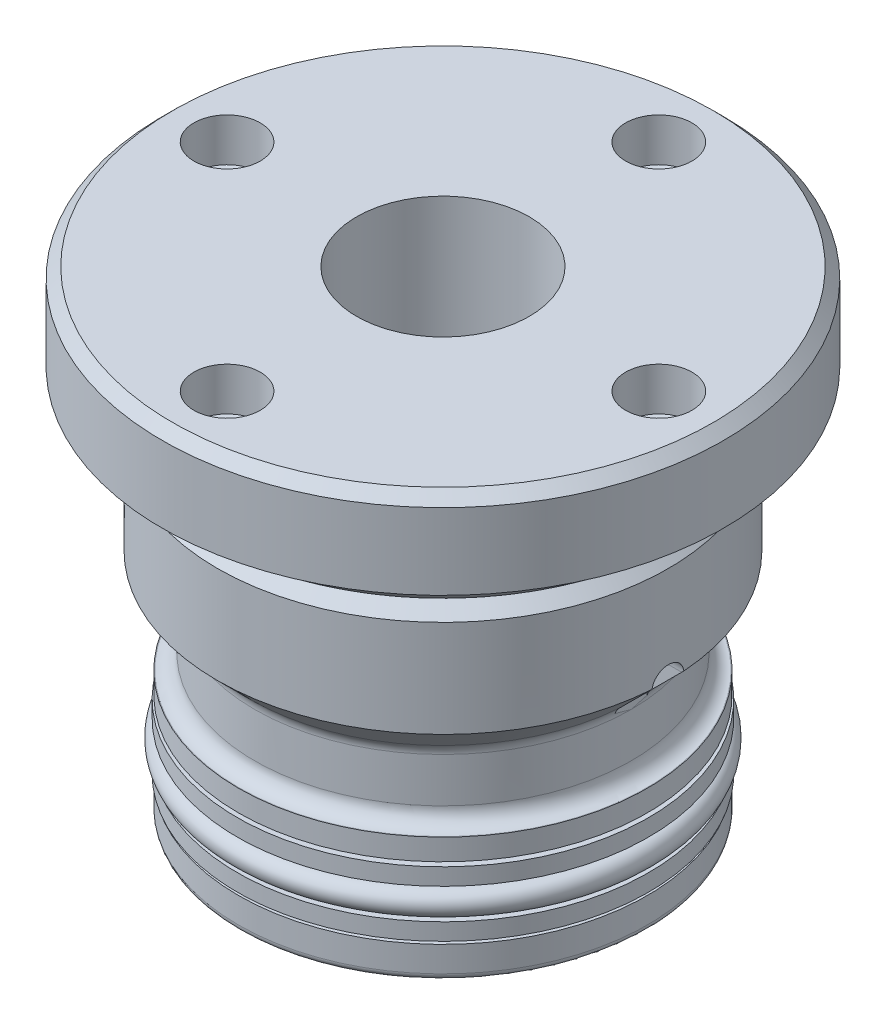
ISO-10303-21;
HEADER;
FILE_DESCRIPTION(('STEP AP214'),'2;1');
FILE_NAME('part.step','',(''),(''),'','','');
FILE_SCHEMA(('AUTOMOTIVE_DESIGN { 1 0 10303 214 1 1 1 1 }'));
ENDSEC;
DATA;
#1=APPLICATION_CONTEXT('core data for automotive mechanical design processes');
#2=APPLICATION_PROTOCOL_DEFINITION('international standard','automotive_design',2000,#1);
#3=PRODUCT_CONTEXT('',#1,'mechanical');
#4=PRODUCT('Part','Part','',(#3));
#5=PRODUCT_RELATED_PRODUCT_CATEGORY('part','',(#4));
#6=PRODUCT_DEFINITION_FORMATION('','',#4);
#7=PRODUCT_DEFINITION_CONTEXT('part definition',#1,'design');
#8=PRODUCT_DEFINITION('design','',#6,#7);
#9=PRODUCT_DEFINITION_SHAPE('','',#8);
#10=(LENGTH_UNIT() NAMED_UNIT(*) SI_UNIT(.MILLI.,.METRE.));
#11=(NAMED_UNIT(*) PLANE_ANGLE_UNIT() SI_UNIT($,.RADIAN.));
#12=(NAMED_UNIT(*) SI_UNIT($,.STERADIAN.) SOLID_ANGLE_UNIT());
#13=UNCERTAINTY_MEASURE_WITH_UNIT(LENGTH_MEASURE(1.E-05),#10,'distance_accuracy_value','');
#14=(GEOMETRIC_REPRESENTATION_CONTEXT(3) GLOBAL_UNCERTAINTY_ASSIGNED_CONTEXT((#13)) GLOBAL_UNIT_ASSIGNED_CONTEXT((#10,
#11,#12)) REPRESENTATION_CONTEXT('',''));
#15=CARTESIAN_POINT('',(0.,0.,0.));
#16=DIRECTION('',(0.,0.,1.));
#17=DIRECTION('',(1.,0.,0.));
#18=AXIS2_PLACEMENT_3D('',#15,#16,#17);
#19=CARTESIAN_POINT('',(0.,16.8529,0.));
#20=DIRECTION('',(0.,1.,0.));
#21=DIRECTION('',(0.,0.,1.));
#22=AXIS2_PLACEMENT_3D('',#19,#20,#21);
#23=CONICAL_SURFACE('',#22,16.5862,0.78539816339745);
#24=CARTESIAN_POINT('',(-16.6819502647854,16.9877199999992,1.14238575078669));
#25=CARTESIAN_POINT('',(-16.6356401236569,16.9423337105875,1.15428526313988));
#26=CARTESIAN_POINT('',(-16.5890641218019,16.8965097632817,1.16344082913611));
#27=CARTESIAN_POINT('',(-16.4956890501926,16.804270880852,1.1762699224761));
#28=CARTESIAN_POINT('',(-16.4488898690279,16.7578556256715,1.17994034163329));
#29=CARTESIAN_POINT('',(-16.3550711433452,16.664412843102,1.18179863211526));
#30=CARTESIAN_POINT('',(-16.3080526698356,16.6173833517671,1.17994414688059));
#31=CARTESIAN_POINT('',(-16.2145262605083,16.5234238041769,1.1705581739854));
#32=CARTESIAN_POINT('',(-16.1680181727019,16.4764937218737,1.16302842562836));
#33=CARTESIAN_POINT('',(-16.0479427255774,16.354779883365,1.13578469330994));
#34=CARTESIAN_POINT('',(-15.9750261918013,16.2803208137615,1.11145547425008));
#35=CARTESIAN_POINT('',(-15.8334687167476,16.1346980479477,1.04661607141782));
#36=CARTESIAN_POINT('',(-15.7648156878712,16.0635251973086,1.00615429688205));
#37=CARTESIAN_POINT('',(-15.6524315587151,15.9461854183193,0.921247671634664));
#38=CARTESIAN_POINT('',(-15.6070631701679,15.8985511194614,0.881007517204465));
#39=CARTESIAN_POINT('',(-15.5213950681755,15.808166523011,0.790764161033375));
#40=CARTESIAN_POINT('',(-15.4810887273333,15.7654098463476,0.740773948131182));
#41=CARTESIAN_POINT('',(-15.4155175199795,15.6955592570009,0.642841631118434));
#42=CARTESIAN_POINT('',(-15.388886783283,15.6670800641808,0.596810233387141));
#43=CARTESIAN_POINT('',(-15.3411261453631,15.6158642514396,0.498991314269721));
#44=CARTESIAN_POINT('',(-15.3199940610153,15.5931253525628,0.44720608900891));
#45=CARTESIAN_POINT('',(-15.2843464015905,15.5546933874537,0.338274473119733));
#46=CARTESIAN_POINT('',(-15.2698954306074,15.5390691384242,0.281081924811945));
#47=CARTESIAN_POINT('',(-15.2490961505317,15.5165617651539,0.16358903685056));
#48=CARTESIAN_POINT('',(-15.2427382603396,15.5096683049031,0.103292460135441));
#49=CARTESIAN_POINT('',(-15.2389948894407,15.5056104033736,-0.00866417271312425));
#50=CARTESIAN_POINT('',(-15.2403911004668,15.5071249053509,-0.0602419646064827));
#51=CARTESIAN_POINT('',(-15.249296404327,15.5167742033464,-0.162225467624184));
#52=CARTESIAN_POINT('',(-15.256804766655,15.5249082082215,-0.212631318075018));
#53=CARTESIAN_POINT('',(-15.2770515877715,15.5468033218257,-0.308991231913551));
#54=CARTESIAN_POINT('',(-15.2895816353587,15.5603401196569,-0.355041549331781));
#55=CARTESIAN_POINT('',(-15.3191916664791,15.5922573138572,-0.443862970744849));
#56=CARTESIAN_POINT('',(-15.3362734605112,15.6106396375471,-0.486632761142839));
#57=CARTESIAN_POINT('',(-15.3816162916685,15.6593022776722,-0.584115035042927));
#58=CARTESIAN_POINT('',(-15.411648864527,15.6914380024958,-0.637080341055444));
#59=CARTESIAN_POINT('',(-15.4773424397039,15.7614191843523,-0.735161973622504));
#60=CARTESIAN_POINT('',(-15.513013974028,15.799275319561,-0.780263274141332));
#61=CARTESIAN_POINT('',(-15.6016632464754,15.8929021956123,-0.8769855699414));
#62=CARTESIAN_POINT('',(-15.6563488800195,15.9503286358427,-0.925431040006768));
#63=CARTESIAN_POINT('',(-15.7707332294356,16.0696356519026,-1.00905615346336));
#64=CARTESIAN_POINT('',(-15.8304405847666,16.1315238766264,-1.04421233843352));
#65=CARTESIAN_POINT('',(-15.9727698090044,16.2780650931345,-1.11154987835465));
#66=CARTESIAN_POINT('',(-16.0565946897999,16.3636482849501,-1.13915338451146));
#67=CARTESIAN_POINT('',(-16.2269362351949,16.5360909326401,-1.1746195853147));
#68=CARTESIAN_POINT('',(-16.3134532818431,16.6229505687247,-1.18247946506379));
#69=CARTESIAN_POINT('',(-16.447301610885,16.756279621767,-1.18004730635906));
#70=CARTESIAN_POINT('',(-16.4945002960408,16.8030946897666,-1.17640131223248));
#71=CARTESIAN_POINT('',(-16.5885328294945,16.8959868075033,-1.16354498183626));
#72=CARTESIAN_POINT('',(-16.6353673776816,16.9420658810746,-1.15435436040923));
#73=CARTESIAN_POINT('',(-16.6819502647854,16.9877199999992,-1.14238575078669));
#74=B_SPLINE_CURVE_WITH_KNOTS('',3,(#24,#25,#26,#27,#28,#29,#30,#31,#32,#33,#34,#35,#36,#37,#38,
#39,#40,#41,#42,#43,#44,#45,#46,#47,#48,#49,#50,#51,#52,#53,#54,#55,#56,#57,#58,#59,#60,#61,#62,
#63,#64,#65,#66,#67,#68,#69,#70,#71,#72,#73),.UNSPECIFIED.,.F.,.F.,(4,2,2,2,2,2,2,2,2,2,2,2,2,2,
2,2,2,2,2,2,2,2,2,2,4),(0.,0.197705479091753,0.395522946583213,0.594860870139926,
0.79413772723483,1.11396727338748,1.43284423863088,1.66343103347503,1.89371271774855,
2.07400971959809,2.25423502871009,2.43616837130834,2.61788612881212,2.77194677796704,
2.92598901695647,3.07420884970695,3.22248772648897,3.42789324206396,3.63368703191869,
3.91095149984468,4.18870313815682,4.55561740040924,4.92258397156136,5.12210947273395,
5.32092967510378),.UNSPECIFIED.);
#75=CARTESIAN_POINT('',(-16.5449173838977,16.8529000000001,1.16950382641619));
#76=VERTEX_POINT('',#75);
#77=CARTESIAN_POINT('',(-16.3785691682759,16.6878,1.18110000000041));
#78=VERTEX_POINT('',#77);
#79=EDGE_CURVE('E192',#76,#78,#74,.T.);
#80=ORIENTED_EDGE('',*,*,#79,.T.);
#81=CARTESIAN_POINT('',(-19.9657258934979,20.2673301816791,1.18110000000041));
#82=CARTESIAN_POINT('',(-19.182617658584,19.4856055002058,1.18110000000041));
#83=CARTESIAN_POINT('',(-18.3994451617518,18.7039451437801,1.18110000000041));
#84=CARTESIAN_POINT('',(-16.8328629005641,17.1408626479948,1.18110000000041));
#85=CARTESIAN_POINT('',(-16.0494531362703,16.3594405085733,1.18110000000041));
#86=CARTESIAN_POINT('',(-14.4822870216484,14.7969434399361,1.18110000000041));
#87=CARTESIAN_POINT('',(-13.6985306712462,14.0158685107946,1.18110000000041));
#88=CARTESIAN_POINT('',(-12.5224639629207,12.8446898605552,1.18110000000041));
#89=CARTESIAN_POINT('',(-12.1303696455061,12.4543692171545,1.18110000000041));
#90=CARTESIAN_POINT('',(-11.3459829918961,11.6739268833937,1.18110000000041));
#91=CARTESIAN_POINT('',(-10.9536906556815,11.2838051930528,1.18110000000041));
#92=CARTESIAN_POINT('',(-10.5612723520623,10.8938101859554,1.18110000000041));
#93=B_SPLINE_CURVE_WITH_KNOTS('',3,(#81,#82,#83,#84,#85,#86,#87,#88,#89,#90,#91,#92),
.UNSPECIFIED.,.F.,.F.,(4,2,2,2,2,4),(0.,3.3195132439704,6.63902562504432,9.95853871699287,
11.6182956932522,13.2780528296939),.UNSPECIFIED.);
#94=CARTESIAN_POINT('',(-14.1284946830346,14.4444769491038,1.18110000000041));
#95=VERTEX_POINT('',#94);
#96=EDGE_CURVE('E273',#78,#95,#93,.T.);
#97=ORIENTED_EDGE('',*,*,#96,.T.);
#98=CARTESIAN_POINT('',(0.,14.4444769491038,0.));
#99=DIRECTION('',(0.,1.,0.));
#100=DIRECTION('',(0.,0.,1.));
#101=AXIS2_PLACEMENT_3D('',#98,#99,#100);
#102=CIRCLE('',#101,14.1777769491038);
#103=CARTESIAN_POINT('',(14.1284946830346,14.4444769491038,1.18110000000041));
#104=VERTEX_POINT('',#103);
#105=EDGE_CURVE('E339',#95,#104,#102,.T.);
#106=ORIENTED_EDGE('',*,*,#105,.T.);
#107=CARTESIAN_POINT('',(18.9980099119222,19.3013888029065,1.18110000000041));
#108=CARTESIAN_POINT('',(18.2148277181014,18.5197380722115,1.18110000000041));
#109=CARTESIAN_POINT('',(17.4315734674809,17.7381594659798,1.18110000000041));
#110=CARTESIAN_POINT('',(15.8647834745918,16.1752850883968,1.18110000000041));
#111=CARTESIAN_POINT('',(15.081247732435,15.3939893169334,1.18110000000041));
#112=CARTESIAN_POINT('',(13.5137564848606,13.831818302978,1.18110000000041));
#113=CARTESIAN_POINT('',(12.7298009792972,13.0509430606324,1.18110000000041));
#114=CARTESIAN_POINT('',(11.5533245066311,11.8801756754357,1.18110000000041));
#115=CARTESIAN_POINT('',(11.1610750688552,11.4900107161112,1.18110000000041));
#116=CARTESIAN_POINT('',(10.3763197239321,10.7099386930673,1.18110000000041));
#117=CARTESIAN_POINT('',(9.98381381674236,10.3200316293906,1.18110000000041));
#118=CARTESIAN_POINT('',(9.59114201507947,9.93029158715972,1.18110000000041));
#119=B_SPLINE_CURVE_WITH_KNOTS('',3,(#107,#108,#109,#110,#111,#112,#113,#114,#115,#116,#117,
#118),.UNSPECIFIED.,.F.,.F.,(4,2,2,2,2,4),(0.,3.31951357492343,6.63902583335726,
9.95853924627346,11.6182966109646,13.2780542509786),.UNSPECIFIED.);
#120=CARTESIAN_POINT('',(16.378569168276,16.6878,1.18110000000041));
#121=VERTEX_POINT('',#120);
#122=EDGE_CURVE('E234',#121,#104,#119,.T.);
#123=ORIENTED_EDGE('',*,*,#122,.F.);
#124=CARTESIAN_POINT('',(16.6819502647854,16.9877199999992,-1.14238575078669));
#125=CARTESIAN_POINT('',(16.6356401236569,16.9423337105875,-1.15428526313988));
#126=CARTESIAN_POINT('',(16.5890641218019,16.8965097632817,-1.16344082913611));
#127=CARTESIAN_POINT('',(16.4956890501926,16.804270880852,-1.1762699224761));
#128=CARTESIAN_POINT('',(16.4488898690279,16.7578556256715,-1.17994034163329));
#129=CARTESIAN_POINT('',(16.3550711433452,16.664412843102,-1.18179863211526));
#130=CARTESIAN_POINT('',(16.3080526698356,16.6173833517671,-1.17994414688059));
#131=CARTESIAN_POINT('',(16.2145262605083,16.5234238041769,-1.1705581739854));
#132=CARTESIAN_POINT('',(16.1680181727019,16.4764937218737,-1.16302842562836));
#133=CARTESIAN_POINT('',(16.0479427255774,16.354779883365,-1.13578469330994));
#134=CARTESIAN_POINT('',(15.9750261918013,16.2803208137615,-1.11145547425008));
#135=CARTESIAN_POINT('',(15.8334687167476,16.1346980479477,-1.04661607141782));
#136=CARTESIAN_POINT('',(15.7648156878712,16.0635251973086,-1.00615429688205));
#137=CARTESIAN_POINT('',(15.6524315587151,15.9461854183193,-0.921247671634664));
#138=CARTESIAN_POINT('',(15.6070631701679,15.8985511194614,-0.881007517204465));
#139=CARTESIAN_POINT('',(15.5213950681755,15.808166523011,-0.790764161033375));
#140=CARTESIAN_POINT('',(15.4810887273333,15.7654098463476,-0.740773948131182));
#141=CARTESIAN_POINT('',(15.4155175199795,15.6955592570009,-0.642841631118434));
#142=CARTESIAN_POINT('',(15.388886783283,15.6670800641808,-0.596810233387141));
#143=CARTESIAN_POINT('',(15.3411261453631,15.6158642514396,-0.498991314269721));
#144=CARTESIAN_POINT('',(15.3199940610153,15.5931253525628,-0.44720608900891));
#145=CARTESIAN_POINT('',(15.2843464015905,15.5546933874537,-0.338274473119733));
#146=CARTESIAN_POINT('',(15.2698954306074,15.5390691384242,-0.281081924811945));
#147=CARTESIAN_POINT('',(15.2490961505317,15.5165617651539,-0.16358903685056));
#148=CARTESIAN_POINT('',(15.2427382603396,15.5096683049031,-0.103292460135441));
#149=CARTESIAN_POINT('',(15.2389948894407,15.5056104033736,0.00866417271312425));
#150=CARTESIAN_POINT('',(15.2403911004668,15.5071249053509,0.0602419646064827));
#151=CARTESIAN_POINT('',(15.249296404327,15.5167742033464,0.162225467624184));
#152=CARTESIAN_POINT('',(15.256804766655,15.5249082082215,0.212631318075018));
#153=CARTESIAN_POINT('',(15.2770515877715,15.5468033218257,0.308991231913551));
#154=CARTESIAN_POINT('',(15.2895816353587,15.5603401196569,0.355041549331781));
#155=CARTESIAN_POINT('',(15.3191916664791,15.5922573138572,0.443862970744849));
#156=CARTESIAN_POINT('',(15.3362734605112,15.6106396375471,0.486632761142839));
#157=CARTESIAN_POINT('',(15.3816162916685,15.6593022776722,0.584115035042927));
#158=CARTESIAN_POINT('',(15.411648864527,15.6914380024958,0.637080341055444));
#159=CARTESIAN_POINT('',(15.4773424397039,15.7614191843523,0.735161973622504));
#160=CARTESIAN_POINT('',(15.513013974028,15.799275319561,0.780263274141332));
#161=CARTESIAN_POINT('',(15.6016632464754,15.8929021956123,0.8769855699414));
#162=CARTESIAN_POINT('',(15.6563488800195,15.9503286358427,0.925431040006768));
#163=CARTESIAN_POINT('',(15.7707332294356,16.0696356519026,1.00905615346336));
#164=CARTESIAN_POINT('',(15.8304405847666,16.1315238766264,1.04421233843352));
#165=CARTESIAN_POINT('',(15.9727698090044,16.2780650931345,1.11154987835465));
#166=CARTESIAN_POINT('',(16.0565946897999,16.3636482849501,1.13915338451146));
#167=CARTESIAN_POINT('',(16.2269362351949,16.5360909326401,1.1746195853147));
#168=CARTESIAN_POINT('',(16.3134532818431,16.6229505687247,1.18247946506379));
#169=CARTESIAN_POINT('',(16.447301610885,16.756279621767,1.18004730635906));
#170=CARTESIAN_POINT('',(16.4945002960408,16.8030946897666,1.17640131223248));
#171=CARTESIAN_POINT('',(16.5885328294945,16.8959868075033,1.16354498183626));
#172=CARTESIAN_POINT('',(16.6353673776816,16.9420658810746,1.15435436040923));
#173=CARTESIAN_POINT('',(16.6819502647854,16.9877199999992,1.14238575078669));
#174=B_SPLINE_CURVE_WITH_KNOTS('',3,(#124,#125,#126,#127,#128,#129,#130,#131,#132,#133,#134,
#135,#136,#137,#138,#139,#140,#141,#142,#143,#144,#145,#146,#147,#148,#149,#150,#151,#152,#153,
#154,#155,#156,#157,#158,#159,#160,#161,#162,#163,#164,#165,#166,#167,#168,#169,#170,#171,#172,
#173),.UNSPECIFIED.,.F.,.F.,(4,2,2,2,2,2,2,2,2,2,2,2,2,2,2,2,2,2,2,2,2,2,2,2,4),(0.,
0.197705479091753,0.395522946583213,0.594860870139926,0.79413772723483,1.11396727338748,
1.43284423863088,1.66343103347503,1.89371271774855,2.07400971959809,2.25423502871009,
2.43616837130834,2.61788612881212,2.77194677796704,2.92598901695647,3.07420884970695,
3.22248772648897,3.42789324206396,3.63368703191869,3.91095149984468,4.18870313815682,
4.55561740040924,4.92258397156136,5.12210947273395,5.32092967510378),.UNSPECIFIED.);
#175=CARTESIAN_POINT('',(16.5449173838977,16.8529,1.16950382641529));
#176=VERTEX_POINT('',#175);
#177=EDGE_CURVE('E211',#121,#176,#174,.T.);
#178=ORIENTED_EDGE('',*,*,#177,.T.);
#179=CARTESIAN_POINT('',(0.,16.8529,0.));
#180=DIRECTION('',(0.,-1.,0.));
#181=DIRECTION('',(0.,0.,-1.));
#182=AXIS2_PLACEMENT_3D('',#179,#180,#181);
#183=CIRCLE('',#182,16.5862);
#184=EDGE_CURVE('E425',#176,#76,#183,.T.);
#185=ORIENTED_EDGE('',*,*,#184,.T.);
#186=EDGE_LOOP('',(#80,#97,#106,#123,#178,#185));
#187=FACE_BOUND('',#186,.T.);
#188=ADVANCED_FACE('F34',(#187),#23,.T.);
#189=CARTESIAN_POINT('',(0.,13.6362538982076,0.));
#190=DIRECTION('',(0.,-1.,0.));
#191=DIRECTION('',(0.,0.,-1.));
#192=AXIS2_PLACEMENT_3D('',#189,#190,#191);
#193=TOROIDAL_SURFACE('',#192,14.986,1.143);
#194=ORIENTED_EDGE('',*,*,#105,.F.);
#195=CARTESIAN_POINT('',(-13.8410398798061,13.9651502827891,1.18110000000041));
#196=CARTESIAN_POINT('',(-13.8225689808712,13.9038867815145,1.18110000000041));
#197=CARTESIAN_POINT('',(-13.8092550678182,13.8410202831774,1.18110000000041));
#198=CARTESIAN_POINT('',(-13.7933629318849,13.7138926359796,1.18110000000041));
#199=CARTESIAN_POINT('',(-13.7907973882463,13.6496299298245,1.18110000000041));
#200=CARTESIAN_POINT('',(-13.7964980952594,13.5216110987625,1.18110000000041));
#201=CARTESIAN_POINT('',(-13.8047592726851,13.4578547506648,1.18110000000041));
#202=CARTESIAN_POINT('',(-13.8318643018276,13.3326509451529,1.18110000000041));
#203=CARTESIAN_POINT('',(-13.850705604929,13.2712029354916,1.18110000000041));
#204=CARTESIAN_POINT('',(-13.898431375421,13.1523141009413,1.18110000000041));
#205=CARTESIAN_POINT('',(-13.927319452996,13.0948747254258,1.18110000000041));
#206=CARTESIAN_POINT('',(-13.9943069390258,12.9856427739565,1.18110000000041));
#207=CARTESIAN_POINT('',(-14.0324067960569,12.9338504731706,1.18110000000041));
#208=CARTESIAN_POINT('',(-14.1168327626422,12.8372443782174,1.18110000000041));
#209=CARTESIAN_POINT('',(-14.1631790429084,12.7924482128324,1.18110000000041));
#210=CARTESIAN_POINT('',(-14.2627120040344,12.7112404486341,1.18110000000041));
#211=CARTESIAN_POINT('',(-14.3158987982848,12.6748289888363,1.18110000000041));
#212=CARTESIAN_POINT('',(-14.4277979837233,12.6112937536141,1.18110000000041));
#213=CARTESIAN_POINT('',(-14.4865286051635,12.5842020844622,1.18110000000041));
#214=CARTESIAN_POINT('',(-14.6076965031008,12.5402336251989,1.18110000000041));
#215=CARTESIAN_POINT('',(-14.6701338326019,12.5233569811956,1.18110000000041));
#216=CARTESIAN_POINT('',(-14.7971195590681,12.5002581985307,1.18110000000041));
#217=CARTESIAN_POINT('',(-14.8616730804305,12.4940642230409,1.18110000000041));
#218=CARTESIAN_POINT('',(-14.9909048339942,12.4925926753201,1.18110000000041));
#219=CARTESIAN_POINT('',(-15.0555830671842,12.4973151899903,1.18110000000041));
#220=CARTESIAN_POINT('',(-15.183277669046,12.517555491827,1.18110000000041));
#221=CARTESIAN_POINT('',(-15.2462927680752,12.5330812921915,1.18110000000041));
#222=CARTESIAN_POINT('',(-15.3688167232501,12.5745050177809,1.18110000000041));
#223=CARTESIAN_POINT('',(-15.4283255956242,12.6004028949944,1.18110000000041));
#224=CARTESIAN_POINT('',(-15.5420644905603,12.6618062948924,1.18110000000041));
#225=CARTESIAN_POINT('',(-15.5963010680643,12.6972996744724,1.18110000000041));
#226=CARTESIAN_POINT('',(-15.698025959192,12.7769098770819,1.18110000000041));
#227=CARTESIAN_POINT('',(-15.7455143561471,12.8210265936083,1.18110000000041));
#228=CARTESIAN_POINT('',(-15.8322649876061,12.9165124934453,1.18110000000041));
#229=CARTESIAN_POINT('',(-15.8715477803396,12.9678629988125,1.18110000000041));
#230=CARTESIAN_POINT('',(-15.9409070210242,13.0764449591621,1.18110000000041));
#231=CARTESIAN_POINT('',(-15.9709836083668,13.1336763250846,1.18110000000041));
#232=CARTESIAN_POINT('',(-16.0209927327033,13.2522285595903,1.18110000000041));
#233=CARTESIAN_POINT('',(-16.0409525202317,13.3135379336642,1.18110000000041));
#234=CARTESIAN_POINT('',(-16.0702743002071,13.4386405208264,1.18110000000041));
#235=CARTESIAN_POINT('',(-16.0796364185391,13.5024337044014,1.18110000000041));
#236=CARTESIAN_POINT('',(-16.0874850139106,13.6305663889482,1.18110000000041));
#237=CARTESIAN_POINT('',(-16.0859916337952,13.6949046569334,1.18110000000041));
#238=CARTESIAN_POINT('',(-16.0722201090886,13.82241609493,1.18110000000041));
#239=CARTESIAN_POINT('',(-16.0599420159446,13.8855892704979,1.18110000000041));
#240=CARTESIAN_POINT('',(-16.0249612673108,14.0089550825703,1.18110000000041));
#241=CARTESIAN_POINT('',(-16.0022623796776,14.0691487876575,1.18110000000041));
#242=CARTESIAN_POINT('',(-15.947093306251,14.1848776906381,1.18110000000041));
#243=CARTESIAN_POINT('',(-15.9146230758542,14.2404128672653,1.18110000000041));
#244=CARTESIAN_POINT('',(-15.8407942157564,14.3453257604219,1.18110000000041));
#245=CARTESIAN_POINT('',(-15.7994245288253,14.3946956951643,1.18110000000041));
#246=CARTESIAN_POINT('',(-15.7090021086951,14.485810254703,1.18110000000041));
#247=CARTESIAN_POINT('',(-15.6599492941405,14.527554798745,1.18110000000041));
#248=CARTESIAN_POINT('',(-15.5554265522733,14.6023439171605,1.18110000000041));
#249=CARTESIAN_POINT('',(-15.4999412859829,14.6353670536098,1.18110000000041));
#250=CARTESIAN_POINT('',(-15.3842256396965,14.6916589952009,1.18110000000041));
#251=CARTESIAN_POINT('',(-15.3239951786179,14.7149276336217,1.18110000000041));
#252=CARTESIAN_POINT('',(-15.2003215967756,14.7511155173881,1.18110000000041));
#253=CARTESIAN_POINT('',(-15.1368701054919,14.7640061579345,1.18110000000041));
#254=CARTESIAN_POINT('',(-15.0087040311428,14.7789749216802,1.18110000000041));
#255=CARTESIAN_POINT('',(-14.9439894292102,14.7810528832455,1.18110000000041));
#256=CARTESIAN_POINT('',(-14.8149985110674,14.7743342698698,1.18110000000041));
#257=CARTESIAN_POINT('',(-14.7507233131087,14.765516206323,1.18110000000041));
#258=CARTESIAN_POINT('',(-14.6245667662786,14.7372173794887,1.18110000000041));
#259=CARTESIAN_POINT('',(-14.5626853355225,14.7177369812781,1.18110000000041));
#260=CARTESIAN_POINT('',(-14.4430669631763,14.6686570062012,1.18110000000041));
#261=CARTESIAN_POINT('',(-14.3853304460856,14.6390563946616,1.18110000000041));
#262=CARTESIAN_POINT('',(-14.2756434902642,14.5705558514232,1.18110000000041));
#263=CARTESIAN_POINT('',(-14.2236944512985,14.5316536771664,1.18110000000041));
#264=CARTESIAN_POINT('',(-14.127162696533,14.4457179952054,1.18110000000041));
#265=CARTESIAN_POINT('',(-14.0825698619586,14.3986958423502,1.18110000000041));
#266=CARTESIAN_POINT('',(-14.001988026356,14.2978450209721,1.18110000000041));
#267=CARTESIAN_POINT('',(-13.9659885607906,14.2440247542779,1.18110000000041));
#268=CARTESIAN_POINT('',(-13.9152972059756,14.1523086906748,1.18110000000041));
#269=CARTESIAN_POINT('',(-13.8976750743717,14.115999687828,1.18110000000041));
#270=CARTESIAN_POINT('',(-13.866366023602,14.0417227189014,1.18110000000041));
#271=CARTESIAN_POINT('',(-13.8526790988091,14.0037547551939,1.18110000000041));
#272=CARTESIAN_POINT('',(-13.8410398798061,13.9651502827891,1.18110000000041));
#273=B_SPLINE_CURVE_WITH_KNOTS('',3,(#195,#196,#197,#198,#199,#200,#201,#202,#203,#204,#205,
#206,#207,#208,#209,#210,#211,#212,#213,#214,#215,#216,#217,#218,#219,#220,#221,#222,#223,#224,
#225,#226,#227,#228,#229,#230,#231,#232,#233,#234,#235,#236,#237,#238,#239,#240,#241,#242,#243,
#244,#245,#246,#247,#248,#249,#250,#251,#252,#253,#254,#255,#256,#257,#258,#259,#260,#261,#262,
#263,#264,#265,#266,#267,#268,#269,#270,#271,#272),.UNSPECIFIED.,.T.,.F.,(4,2,2,2,2,2,2,2,2,2,2,
2,2,2,2,2,2,2,2,2,2,2,2,2,2,2,2,2,2,2,2,2,2,2,2,2,2,2,4),(0.,0.191815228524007,
0.383856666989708,0.575808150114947,0.767713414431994,0.959687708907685,1.15167135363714,
1.34413121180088,1.53659426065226,1.7297138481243,1.9228361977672,2.11646691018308,
2.31009916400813,2.50387519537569,2.6976503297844,2.89118138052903,3.08471004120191,
3.27774786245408,3.47078276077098,3.6632949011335,3.85580475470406,4.0479574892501,
4.24010930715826,4.43219170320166,4.6242749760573,4.81659829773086,5.00892365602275,
5.20171745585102,5.39451455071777,5.58784124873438,5.78117083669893,5.97488230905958,
6.16858714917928,6.36231179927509,6.55608320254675,6.74958580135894,6.94285154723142,
7.0637218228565,7.18459192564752),.UNSPECIFIED.);
#274=CARTESIAN_POINT('',(-13.843,13.9715818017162,1.18110000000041));
#275=VERTEX_POINT('',#274);
#276=EDGE_CURVE('E252',#95,#275,#273,.T.);
#277=ORIENTED_EDGE('',*,*,#276,.T.);
#278=CARTESIAN_POINT('',(-13.843,13.6362538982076,0.));
#279=CARTESIAN_POINT('',(-13.843,13.6384201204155,0.0075386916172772));
#280=CARTESIAN_POINT('',(-13.843,13.6405863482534,0.0150773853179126));
#281=CARTESIAN_POINT('',(-13.843,13.7480109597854,0.388930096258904));
#282=CARTESIAN_POINT('',(-13.843,13.8532195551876,0.755266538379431));
#283=CARTESIAN_POINT('',(-13.843,14.0063269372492,1.30596826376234));
#284=CARTESIAN_POINT('',(-13.843,14.0565637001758,1.48967813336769));
#285=CARTESIAN_POINT('',(-13.843,14.154671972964,1.85777999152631));
#286=CARTESIAN_POINT('',(-13.843,14.2025428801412,2.0421721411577));
#287=CARTESIAN_POINT('',(-13.843,14.3221132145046,2.5199924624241));
#288=CARTESIAN_POINT('',(-13.843,14.39135245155,2.81404588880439));
#289=CARTESIAN_POINT('',(-13.843,14.5176054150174,3.40462878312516));
#290=CARTESIAN_POINT('',(-13.843,14.5746281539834,3.70115625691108));
#291=CARTESIAN_POINT('',(-13.843,14.6472844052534,4.14896474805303));
#292=CARTESIAN_POINT('',(-13.843,14.6694035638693,4.29919152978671));
#293=CARTESIAN_POINT('',(-13.843,14.7083956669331,4.60030093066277));
#294=CARTESIAN_POINT('',(-13.843,14.7252697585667,4.75118339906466));
#295=CARTESIAN_POINT('',(-13.843,14.7528201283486,5.05396395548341));
#296=CARTESIAN_POINT('',(-13.843,14.7634788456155,5.20586370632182));
#297=CARTESIAN_POINT('',(-13.843,14.7738093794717,5.43402419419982));
#298=CARTESIAN_POINT('',(-13.843,14.7763098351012,5.51015975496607));
#299=CARTESIAN_POINT('',(-13.843,14.7792203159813,5.66248160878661));
#300=CARTESIAN_POINT('',(-13.843,14.7796300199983,5.73866790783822));
#301=CARTESIAN_POINT('',(-13.843,14.7788935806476,5.81485142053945));
#302=B_SPLINE_CURVE_WITH_KNOTS('',3,(#278,#279,#280,#281,#282,#283,#284,#285,#286,#287,#288,
#289,#290,#291,#292,#293,#294,#295,#296,#297,#298,#299,#300,#301),.UNSPECIFIED.,.F.,.F.,(4,2,2,
2,2,2,2,2,2,2,2,4),(0.,0.0235312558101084,1.16694125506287,1.7382936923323,2.3097909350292,
3.215920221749,4.12137870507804,4.57684388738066,5.03220938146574,5.48885530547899,
5.71735957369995,5.94589894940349),.UNSPECIFIED.);
#303=CARTESIAN_POINT('',(-13.843,13.6362538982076,0.));
#304=VERTEX_POINT('',#303);
#305=EDGE_CURVE('E319',#304,#275,#302,.T.);
#306=ORIENTED_EDGE('',*,*,#305,.F.);
#307=CARTESIAN_POINT('',(0.,13.6362538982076,0.));
#308=DIRECTION('',(0.,-1.,0.));
#309=DIRECTION('',(0.,0.,-1.));
#310=AXIS2_PLACEMENT_3D('',#307,#308,#309);
#311=CIRCLE('',#310,13.843);
#312=CARTESIAN_POINT('',(13.843,13.6362538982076,0.));
#313=VERTEX_POINT('',#312);
#314=EDGE_CURVE('E331',#313,#304,#311,.T.);
#315=ORIENTED_EDGE('',*,*,#314,.F.);
#316=CARTESIAN_POINT('',(13.843,13.6362538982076,0.));
#317=CARTESIAN_POINT('',(13.843,13.6384201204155,0.0075386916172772));
#318=CARTESIAN_POINT('',(13.843,13.6405863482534,0.0150773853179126));
#319=CARTESIAN_POINT('',(13.843,13.7480109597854,0.388930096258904));
#320=CARTESIAN_POINT('',(13.843,13.8532195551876,0.755266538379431));
#321=CARTESIAN_POINT('',(13.843,14.0063269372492,1.30596826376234));
#322=CARTESIAN_POINT('',(13.843,14.0565637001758,1.48967813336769));
#323=CARTESIAN_POINT('',(13.843,14.154671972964,1.85777999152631));
#324=CARTESIAN_POINT('',(13.843,14.2025428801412,2.0421721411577));
#325=CARTESIAN_POINT('',(13.843,14.3221132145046,2.5199924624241));
#326=CARTESIAN_POINT('',(13.843,14.39135245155,2.81404588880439));
#327=CARTESIAN_POINT('',(13.843,14.5176054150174,3.40462878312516));
#328=CARTESIAN_POINT('',(13.843,14.5746281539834,3.70115625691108));
#329=CARTESIAN_POINT('',(13.843,14.6472844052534,4.14896474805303));
#330=CARTESIAN_POINT('',(13.843,14.6694035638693,4.29919152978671));
#331=CARTESIAN_POINT('',(13.843,14.7083956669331,4.60030093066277));
#332=CARTESIAN_POINT('',(13.843,14.7252697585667,4.75118339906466));
#333=CARTESIAN_POINT('',(13.843,14.7528201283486,5.05396395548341));
#334=CARTESIAN_POINT('',(13.843,14.7634788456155,5.20586370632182));
#335=CARTESIAN_POINT('',(13.843,14.7738093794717,5.43402419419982));
#336=CARTESIAN_POINT('',(13.843,14.7763098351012,5.51015975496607));
#337=CARTESIAN_POINT('',(13.843,14.7792203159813,5.66248160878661));
#338=CARTESIAN_POINT('',(13.843,14.7796300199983,5.73866790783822));
#339=CARTESIAN_POINT('',(13.843,14.7788935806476,5.81485142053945));
#340=B_SPLINE_CURVE_WITH_KNOTS('',3,(#316,#317,#318,#319,#320,#321,#322,#323,#324,#325,#326,
#327,#328,#329,#330,#331,#332,#333,#334,#335,#336,#337,#338,#339),.UNSPECIFIED.,.F.,.F.,(4,2,2,
2,2,2,2,2,2,2,2,4),(0.,0.0235312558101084,1.16694125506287,1.7382936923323,2.3097909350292,
3.215920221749,4.12137870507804,4.57684388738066,5.03220938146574,5.48885530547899,
5.71735957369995,5.94589894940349),.UNSPECIFIED.);
#341=CARTESIAN_POINT('',(13.843,13.9715818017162,1.18110000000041));
#342=VERTEX_POINT('',#341);
#343=EDGE_CURVE('E283',#342,#313,#340,.F.);
#344=ORIENTED_EDGE('',*,*,#343,.F.);
#345=CARTESIAN_POINT('',(13.8410398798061,13.9651502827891,1.18110000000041));
#346=CARTESIAN_POINT('',(13.8225689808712,13.9038867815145,1.18110000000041));
#347=CARTESIAN_POINT('',(13.8092550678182,13.8410202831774,1.18110000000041));
#348=CARTESIAN_POINT('',(13.7933629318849,13.7138926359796,1.18110000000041));
#349=CARTESIAN_POINT('',(13.7907973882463,13.6496299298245,1.18110000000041));
#350=CARTESIAN_POINT('',(13.7964980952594,13.5216110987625,1.18110000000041));
#351=CARTESIAN_POINT('',(13.8047592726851,13.4578547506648,1.18110000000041));
#352=CARTESIAN_POINT('',(13.8318643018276,13.3326509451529,1.18110000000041));
#353=CARTESIAN_POINT('',(13.850705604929,13.2712029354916,1.18110000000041));
#354=CARTESIAN_POINT('',(13.898431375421,13.1523141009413,1.18110000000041));
#355=CARTESIAN_POINT('',(13.927319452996,13.0948747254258,1.18110000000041));
#356=CARTESIAN_POINT('',(13.9943069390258,12.9856427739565,1.18110000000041));
#357=CARTESIAN_POINT('',(14.0324067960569,12.9338504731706,1.18110000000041));
#358=CARTESIAN_POINT('',(14.1168327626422,12.8372443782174,1.18110000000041));
#359=CARTESIAN_POINT('',(14.1631790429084,12.7924482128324,1.18110000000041));
#360=CARTESIAN_POINT('',(14.2627120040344,12.7112404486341,1.18110000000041));
#361=CARTESIAN_POINT('',(14.3158987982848,12.6748289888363,1.18110000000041));
#362=CARTESIAN_POINT('',(14.4277979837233,12.6112937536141,1.18110000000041));
#363=CARTESIAN_POINT('',(14.4865286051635,12.5842020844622,1.18110000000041));
#364=CARTESIAN_POINT('',(14.6076965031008,12.5402336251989,1.18110000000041));
#365=CARTESIAN_POINT('',(14.6701338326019,12.5233569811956,1.18110000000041));
#366=CARTESIAN_POINT('',(14.7971195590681,12.5002581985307,1.18110000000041));
#367=CARTESIAN_POINT('',(14.8616730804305,12.4940642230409,1.18110000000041));
#368=CARTESIAN_POINT('',(14.9909048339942,12.4925926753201,1.18110000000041));
#369=CARTESIAN_POINT('',(15.0555830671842,12.4973151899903,1.18110000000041));
#370=CARTESIAN_POINT('',(15.183277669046,12.517555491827,1.18110000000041));
#371=CARTESIAN_POINT('',(15.2462927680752,12.5330812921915,1.18110000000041));
#372=CARTESIAN_POINT('',(15.3688167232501,12.5745050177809,1.18110000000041));
#373=CARTESIAN_POINT('',(15.4283255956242,12.6004028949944,1.18110000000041));
#374=CARTESIAN_POINT('',(15.5420644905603,12.6618062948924,1.18110000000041));
#375=CARTESIAN_POINT('',(15.5963010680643,12.6972996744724,1.18110000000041));
#376=CARTESIAN_POINT('',(15.698025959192,12.7769098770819,1.18110000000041));
#377=CARTESIAN_POINT('',(15.7455143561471,12.8210265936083,1.18110000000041));
#378=CARTESIAN_POINT('',(15.8322649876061,12.9165124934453,1.18110000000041));
#379=CARTESIAN_POINT('',(15.8715477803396,12.9678629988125,1.18110000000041));
#380=CARTESIAN_POINT('',(15.9409070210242,13.0764449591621,1.18110000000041));
#381=CARTESIAN_POINT('',(15.9709836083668,13.1336763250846,1.18110000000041));
#382=CARTESIAN_POINT('',(16.0209927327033,13.2522285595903,1.18110000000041));
#383=CARTESIAN_POINT('',(16.0409525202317,13.3135379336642,1.18110000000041));
#384=CARTESIAN_POINT('',(16.0702743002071,13.4386405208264,1.18110000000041));
#385=CARTESIAN_POINT('',(16.0796364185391,13.5024337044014,1.18110000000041));
#386=CARTESIAN_POINT('',(16.0874850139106,13.6305663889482,1.18110000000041));
#387=CARTESIAN_POINT('',(16.0859916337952,13.6949046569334,1.18110000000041));
#388=CARTESIAN_POINT('',(16.0722201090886,13.82241609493,1.18110000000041));
#389=CARTESIAN_POINT('',(16.0599420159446,13.8855892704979,1.18110000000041));
#390=CARTESIAN_POINT('',(16.0249612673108,14.0089550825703,1.18110000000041));
#391=CARTESIAN_POINT('',(16.0022623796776,14.0691487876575,1.18110000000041));
#392=CARTESIAN_POINT('',(15.947093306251,14.1848776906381,1.18110000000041));
#393=CARTESIAN_POINT('',(15.9146230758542,14.2404128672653,1.18110000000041));
#394=CARTESIAN_POINT('',(15.8407942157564,14.3453257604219,1.18110000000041));
#395=CARTESIAN_POINT('',(15.7994245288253,14.3946956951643,1.18110000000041));
#396=CARTESIAN_POINT('',(15.7090021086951,14.485810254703,1.18110000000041));
#397=CARTESIAN_POINT('',(15.6599492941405,14.527554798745,1.18110000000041));
#398=CARTESIAN_POINT('',(15.5554265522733,14.6023439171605,1.18110000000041));
#399=CARTESIAN_POINT('',(15.4999412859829,14.6353670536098,1.18110000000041));
#400=CARTESIAN_POINT('',(15.3842256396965,14.6916589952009,1.18110000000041));
#401=CARTESIAN_POINT('',(15.3239951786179,14.7149276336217,1.18110000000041));
#402=CARTESIAN_POINT('',(15.2003215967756,14.7511155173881,1.18110000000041));
#403=CARTESIAN_POINT('',(15.1368701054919,14.7640061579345,1.18110000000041));
#404=CARTESIAN_POINT('',(15.0087040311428,14.7789749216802,1.18110000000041));
#405=CARTESIAN_POINT('',(14.9439894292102,14.7810528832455,1.18110000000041));
#406=CARTESIAN_POINT('',(14.8149985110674,14.7743342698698,1.18110000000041));
#407=CARTESIAN_POINT('',(14.7507233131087,14.765516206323,1.18110000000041));
#408=CARTESIAN_POINT('',(14.6245667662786,14.7372173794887,1.18110000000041));
#409=CARTESIAN_POINT('',(14.5626853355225,14.7177369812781,1.18110000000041));
#410=CARTESIAN_POINT('',(14.4430669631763,14.6686570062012,1.18110000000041));
#411=CARTESIAN_POINT('',(14.3853304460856,14.6390563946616,1.18110000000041));
#412=CARTESIAN_POINT('',(14.2756434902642,14.5705558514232,1.18110000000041));
#413=CARTESIAN_POINT('',(14.2236944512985,14.5316536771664,1.18110000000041));
#414=CARTESIAN_POINT('',(14.127162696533,14.4457179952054,1.18110000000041));
#415=CARTESIAN_POINT('',(14.0825698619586,14.3986958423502,1.18110000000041));
#416=CARTESIAN_POINT('',(14.001988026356,14.2978450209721,1.18110000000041));
#417=CARTESIAN_POINT('',(13.9659885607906,14.2440247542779,1.18110000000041));
#418=CARTESIAN_POINT('',(13.9152972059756,14.1523086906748,1.18110000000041));
#419=CARTESIAN_POINT('',(13.8976750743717,14.115999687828,1.18110000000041));
#420=CARTESIAN_POINT('',(13.866366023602,14.0417227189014,1.18110000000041));
#421=CARTESIAN_POINT('',(13.8526790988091,14.0037547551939,1.18110000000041));
#422=CARTESIAN_POINT('',(13.8410398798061,13.9651502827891,1.18110000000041));
#423=B_SPLINE_CURVE_WITH_KNOTS('',3,(#345,#346,#347,#348,#349,#350,#351,#352,#353,#354,#355,
#356,#357,#358,#359,#360,#361,#362,#363,#364,#365,#366,#367,#368,#369,#370,#371,#372,#373,#374,
#375,#376,#377,#378,#379,#380,#381,#382,#383,#384,#385,#386,#387,#388,#389,#390,#391,#392,#393,
#394,#395,#396,#397,#398,#399,#400,#401,#402,#403,#404,#405,#406,#407,#408,#409,#410,#411,#412,
#413,#414,#415,#416,#417,#418,#419,#420,#421,#422),.UNSPECIFIED.,.T.,.F.,(4,2,2,2,2,2,2,2,2,2,2,
2,2,2,2,2,2,2,2,2,2,2,2,2,2,2,2,2,2,2,2,2,2,2,2,2,2,2,4),(0.,0.191815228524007,
0.383856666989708,0.575808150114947,0.767713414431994,0.959687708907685,1.15167135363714,
1.34413121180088,1.53659426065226,1.7297138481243,1.9228361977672,2.11646691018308,
2.31009916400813,2.50387519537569,2.6976503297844,2.89118138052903,3.08471004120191,
3.27774786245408,3.47078276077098,3.6632949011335,3.85580475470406,4.0479574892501,
4.24010930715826,4.43219170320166,4.6242749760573,4.81659829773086,5.00892365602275,
5.20171745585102,5.39451455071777,5.58784124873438,5.78117083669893,5.97488230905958,
6.16858714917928,6.36231179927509,6.55608320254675,6.74958580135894,6.94285154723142,
7.0637218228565,7.18459192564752),.UNSPECIFIED.);
#424=EDGE_CURVE('E307',#104,#342,#423,.T.);
#425=ORIENTED_EDGE('',*,*,#424,.F.);
#426=EDGE_LOOP('',(#194,#277,#306,#315,#344,#425));
#427=FACE_BOUND('',#426,.T.);
#428=ADVANCED_FACE('F220',(#427),#193,.F.);
#429=CARTESIAN_POINT('',(14.1284946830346,14.4444769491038,-1.18110000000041));
#430=VERTEX_POINT('',#429);
#431=CARTESIAN_POINT('',(-14.1284946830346,14.4444769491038,-1.18110000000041));
#432=VERTEX_POINT('',#431);
#433=EDGE_CURVE('E340',#430,#432,#102,.T.);
#434=ORIENTED_EDGE('',*,*,#433,.T.);
#435=CARTESIAN_POINT('',(-10.5612723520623,10.8938101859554,-1.18110000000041));
#436=CARTESIAN_POINT('',(-10.9536906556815,11.2838051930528,-1.18110000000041));
#437=CARTESIAN_POINT('',(-11.3459829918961,11.6739268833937,-1.18110000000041));
#438=CARTESIAN_POINT('',(-12.1303696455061,12.4543692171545,-1.18110000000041));
#439=CARTESIAN_POINT('',(-12.5224639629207,12.8446898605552,-1.18110000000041));
#440=CARTESIAN_POINT('',(-13.6985306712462,14.0158685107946,-1.18110000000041));
#441=CARTESIAN_POINT('',(-14.4822870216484,14.7969434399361,-1.18110000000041));
#442=CARTESIAN_POINT('',(-16.0494531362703,16.3594405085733,-1.18110000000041));
#443=CARTESIAN_POINT('',(-16.8328629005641,17.1408626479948,-1.18110000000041));
#444=CARTESIAN_POINT('',(-18.3994451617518,18.7039451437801,-1.18110000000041));
#445=CARTESIAN_POINT('',(-19.182617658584,19.4856055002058,-1.18110000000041));
#446=CARTESIAN_POINT('',(-19.9657258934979,20.2673301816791,-1.18110000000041));
#447=B_SPLINE_CURVE_WITH_KNOTS('',3,(#435,#436,#437,#438,#439,#440,#441,#442,#443,#444,#445,
#446),.UNSPECIFIED.,.F.,.F.,(4,2,2,2,2,4),(0.,1.65975713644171,3.31951411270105,6.6390272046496,
9.95853958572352,13.2780528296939),.UNSPECIFIED.);
#448=CARTESIAN_POINT('',(-16.3785691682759,16.6878,-1.18110000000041));
#449=VERTEX_POINT('',#448);
#450=EDGE_CURVE('E245',#432,#449,#447,.T.);
#451=ORIENTED_EDGE('',*,*,#450,.T.);
#452=CARTESIAN_POINT('',(-16.5449173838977,16.8529,-1.16950382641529));
#453=VERTEX_POINT('',#452);
#454=EDGE_CURVE('E148',#449,#453,#74,.T.);
#455=ORIENTED_EDGE('',*,*,#454,.T.);
#456=CARTESIAN_POINT('',(16.5449173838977,16.8529000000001,-1.16950382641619));
#457=VERTEX_POINT('',#456);
#458=EDGE_CURVE('E429',#453,#457,#183,.T.);
#459=ORIENTED_EDGE('',*,*,#458,.T.);
#460=CARTESIAN_POINT('',(16.378569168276,16.6878,-1.18110000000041));
#461=VERTEX_POINT('',#460);
#462=EDGE_CURVE('E205',#457,#461,#174,.T.);
#463=ORIENTED_EDGE('',*,*,#462,.T.);
#464=CARTESIAN_POINT('',(9.59114201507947,9.93029158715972,-1.18110000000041));
#465=CARTESIAN_POINT('',(9.98381381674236,10.3200316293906,-1.18110000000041));
#466=CARTESIAN_POINT('',(10.3763197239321,10.7099386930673,-1.18110000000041));
#467=CARTESIAN_POINT('',(11.1610750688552,11.4900107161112,-1.18110000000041));
#468=CARTESIAN_POINT('',(11.5533245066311,11.8801756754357,-1.18110000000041));
#469=CARTESIAN_POINT('',(12.7298009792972,13.0509430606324,-1.18110000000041));
#470=CARTESIAN_POINT('',(13.5137564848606,13.831818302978,-1.18110000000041));
#471=CARTESIAN_POINT('',(15.081247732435,15.3939893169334,-1.18110000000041));
#472=CARTESIAN_POINT('',(15.8647834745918,16.1752850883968,-1.18110000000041));
#473=CARTESIAN_POINT('',(17.4315734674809,17.7381594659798,-1.18110000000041));
#474=CARTESIAN_POINT('',(18.2148277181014,18.5197380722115,-1.18110000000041));
#475=CARTESIAN_POINT('',(18.9980099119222,19.3013888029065,-1.18110000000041));
#476=B_SPLINE_CURVE_WITH_KNOTS('',3,(#464,#465,#466,#467,#468,#469,#470,#471,#472,#473,#474,
#475),.UNSPECIFIED.,.F.,.F.,(4,2,2,2,2,4),(0.,1.65975764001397,3.31951500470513,
6.63902841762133,9.95854067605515,13.2780542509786),.UNSPECIFIED.);
#477=EDGE_CURVE('E240',#430,#461,#476,.T.);
#478=ORIENTED_EDGE('',*,*,#477,.F.);
#479=EDGE_LOOP('',(#434,#451,#455,#459,#463,#478));
#480=FACE_BOUND('',#479,.T.);
#481=ADVANCED_FACE('F216',(#480),#23,.T.);
#482=CARTESIAN_POINT('',(-13.843,13.6362538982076,0.));
#483=CARTESIAN_POINT('',(-13.843,13.6384201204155,-0.0075386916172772));
#484=CARTESIAN_POINT('',(-13.843,13.6405863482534,-0.0150773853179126));
#485=CARTESIAN_POINT('',(-13.843,13.7480109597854,-0.388930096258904));
#486=CARTESIAN_POINT('',(-13.843,13.8532195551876,-0.755266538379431));
#487=CARTESIAN_POINT('',(-13.843,14.0063269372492,-1.30596826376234));
#488=CARTESIAN_POINT('',(-13.843,14.0565637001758,-1.48967813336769));
#489=CARTESIAN_POINT('',(-13.843,14.154671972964,-1.85777999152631));
#490=CARTESIAN_POINT('',(-13.843,14.2025428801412,-2.0421721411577));
#491=CARTESIAN_POINT('',(-13.843,14.3221132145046,-2.5199924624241));
#492=CARTESIAN_POINT('',(-13.843,14.39135245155,-2.81404588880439));
#493=CARTESIAN_POINT('',(-13.843,14.5176054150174,-3.40462878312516));
#494=CARTESIAN_POINT('',(-13.843,14.5746281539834,-3.70115625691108));
#495=CARTESIAN_POINT('',(-13.843,14.6472844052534,-4.14896474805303));
#496=CARTESIAN_POINT('',(-13.843,14.6694035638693,-4.29919152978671));
#497=CARTESIAN_POINT('',(-13.843,14.7083956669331,-4.60030093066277));
#498=CARTESIAN_POINT('',(-13.843,14.7252697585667,-4.75118339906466));
#499=CARTESIAN_POINT('',(-13.843,14.7528201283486,-5.05396395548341));
#500=CARTESIAN_POINT('',(-13.843,14.7634788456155,-5.20586370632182));
#501=CARTESIAN_POINT('',(-13.843,14.7738093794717,-5.43402419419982));
#502=CARTESIAN_POINT('',(-13.843,14.7763098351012,-5.51015975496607));
#503=CARTESIAN_POINT('',(-13.843,14.7792203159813,-5.66248160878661));
#504=CARTESIAN_POINT('',(-13.843,14.7796300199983,-5.73866790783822));
#505=CARTESIAN_POINT('',(-13.843,14.7788935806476,-5.81485142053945));
#506=B_SPLINE_CURVE_WITH_KNOTS('',3,(#482,#483,#484,#485,#486,#487,#488,#489,#490,#491,#492,
#493,#494,#495,#496,#497,#498,#499,#500,#501,#502,#503,#504,#505),.UNSPECIFIED.,.F.,.F.,(4,2,2,
2,2,2,2,2,2,2,2,4),(0.,0.0235312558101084,1.16694125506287,1.7382936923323,2.3097909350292,
3.215920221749,4.12137870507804,4.57684388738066,5.03220938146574,5.48885530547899,
5.71735957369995,5.94589894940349),.UNSPECIFIED.);
#507=CARTESIAN_POINT('',(-13.843,13.9715818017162,-1.18110000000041));
#508=VERTEX_POINT('',#507);
#509=EDGE_CURVE('E142',#508,#304,#506,.F.);
#510=ORIENTED_EDGE('',*,*,#509,.F.);
#511=CARTESIAN_POINT('',(-13.8410398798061,13.9651502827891,-1.18110000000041));
#512=CARTESIAN_POINT('',(-13.8595708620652,14.0265931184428,-1.18110000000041));
#513=CARTESIAN_POINT('',(-13.8833164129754,14.0865128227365,-1.18110000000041));
#514=CARTESIAN_POINT('',(-13.9405605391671,14.201559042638,-1.18110000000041));
#515=CARTESIAN_POINT('',(-13.9740710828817,14.2566795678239,-1.18110000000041));
#516=CARTESIAN_POINT('',(-14.0498478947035,14.3604864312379,-1.18110000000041));
#517=CARTESIAN_POINT('',(-14.0921087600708,14.4091767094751,-1.18110000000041));
#518=CARTESIAN_POINT('',(-14.1841751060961,14.498778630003,-1.18110000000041));
#519=CARTESIAN_POINT('',(-14.2339787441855,14.5396921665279,-1.18110000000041));
#520=CARTESIAN_POINT('',(-14.3398590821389,14.6127118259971,-1.18110000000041));
#521=CARTESIAN_POINT('',(-14.3959514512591,14.6447952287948,-1.18110000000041));
#522=CARTESIAN_POINT('',(-14.5127166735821,14.6991232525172,-1.18110000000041));
#523=CARTESIAN_POINT('',(-14.5733897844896,14.7213673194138,-1.18110000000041));
#524=CARTESIAN_POINT('',(-14.6977856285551,14.755447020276,-1.18110000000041));
#525=CARTESIAN_POINT('',(-14.7615168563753,14.7672516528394,-1.18110000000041));
#526=CARTESIAN_POINT('',(-14.8900565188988,14.7800092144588,-1.18110000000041));
#527=CARTESIAN_POINT('',(-14.9548649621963,14.780962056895,-1.18110000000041));
#528=CARTESIAN_POINT('',(-15.0838075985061,14.7719809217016,-1.18110000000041));
#529=CARTESIAN_POINT('',(-15.1479408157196,14.7620329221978,-1.18110000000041));
#530=CARTESIAN_POINT('',(-15.2736244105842,14.731502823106,-1.18110000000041));
#531=CARTESIAN_POINT('',(-15.335174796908,14.7109207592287,-1.18110000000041));
#532=CARTESIAN_POINT('',(-15.4538909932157,14.6597172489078,-1.18110000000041));
#533=CARTESIAN_POINT('',(-15.5110601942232,14.6291036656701,-1.18110000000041));
#534=CARTESIAN_POINT('',(-15.6194317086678,14.558691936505,-1.18110000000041));
#535=CARTESIAN_POINT('',(-15.670634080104,14.518893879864,-1.18110000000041));
#536=CARTESIAN_POINT('',(-15.7654902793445,14.4313389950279,-1.18110000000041));
#537=CARTESIAN_POINT('',(-15.8091612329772,14.383600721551,-1.18110000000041));
#538=CARTESIAN_POINT('',(-15.8878417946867,14.2814524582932,-1.18110000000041));
#539=CARTESIAN_POINT('',(-15.9228515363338,14.227042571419,-1.18110000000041));
#540=CARTESIAN_POINT('',(-15.983114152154,14.1132577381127,-1.18110000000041));
#541=CARTESIAN_POINT('',(-16.0083938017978,14.0538969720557,-1.18110000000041));
#542=CARTESIAN_POINT('',(-16.0486039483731,13.9317680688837,-1.18110000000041));
#543=CARTESIAN_POINT('',(-16.0635345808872,13.8689999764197,-1.18110000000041));
#544=CARTESIAN_POINT('',(-16.0825942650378,13.7419836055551,-1.18110000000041));
#545=CARTESIAN_POINT('',(-16.0867465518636,13.6777388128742,-1.18110000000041));
#546=CARTESIAN_POINT('',(-16.0841970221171,13.5494652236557,-1.18110000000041));
#547=CARTESIAN_POINT('',(-16.0774952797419,13.4854364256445,-1.18110000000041));
#548=CARTESIAN_POINT('',(-16.053440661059,13.3594643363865,-1.18110000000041));
#549=CARTESIAN_POINT('',(-16.0360961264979,13.297519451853,-1.18110000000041));
#550=CARTESIAN_POINT('',(-15.9912621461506,13.177417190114,-1.18110000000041));
#551=CARTESIAN_POINT('',(-15.9637726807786,13.1192598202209,-1.18110000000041));
#552=CARTESIAN_POINT('',(-15.8994095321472,13.0083273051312,-1.18110000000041));
#553=CARTESIAN_POINT('',(-15.8625278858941,12.9555567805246,-1.18110000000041));
#554=CARTESIAN_POINT('',(-15.7804466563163,12.8569394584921,-1.18110000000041));
#555=CARTESIAN_POINT('',(-15.7352469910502,12.8110927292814,-1.18110000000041));
#556=CARTESIAN_POINT('',(-15.6377087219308,12.7275144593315,-1.18110000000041));
#557=CARTESIAN_POINT('',(-15.5853546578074,12.6898009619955,-1.18110000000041));
#558=CARTESIAN_POINT('',(-15.4750722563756,12.623670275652,-1.18110000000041));
#559=CARTESIAN_POINT('',(-15.4171438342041,12.5952532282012,-1.18110000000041));
#560=CARTESIAN_POINT('',(-15.2971852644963,12.5484394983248,-1.18110000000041));
#561=CARTESIAN_POINT('',(-15.2351441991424,12.5300707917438,-1.18110000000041));
#562=CARTESIAN_POINT('',(-15.1088619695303,12.5039835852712,-1.18110000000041));
#563=CARTESIAN_POINT('',(-15.0446207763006,12.4962652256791,-1.18110000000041));
#564=CARTESIAN_POINT('',(-14.9156062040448,12.4916853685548,-1.18110000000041));
#565=CARTESIAN_POINT('',(-14.8508319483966,12.4948485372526,-1.18110000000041));
#566=CARTESIAN_POINT('',(-14.722731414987,12.5119958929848,-1.18110000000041));
#567=CARTESIAN_POINT('',(-14.6594051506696,12.5259801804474,-1.18110000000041));
#568=CARTESIAN_POINT('',(-14.5359523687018,12.5643923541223,-1.18110000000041));
#569=CARTESIAN_POINT('',(-14.4758282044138,12.5888278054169,-1.18110000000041));
#570=CARTESIAN_POINT('',(-14.3605429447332,12.6474589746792,-1.18110000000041));
#571=CARTESIAN_POINT('',(-14.305381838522,12.6816546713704,-1.18110000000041));
#572=CARTESIAN_POINT('',(-14.2016723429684,12.758793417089,-1.18110000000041));
#573=CARTESIAN_POINT('',(-14.1531152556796,12.8017247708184,-1.18110000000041));
#574=CARTESIAN_POINT('',(-14.0639266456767,12.8951507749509,-1.18110000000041));
#575=CARTESIAN_POINT('',(-14.0232946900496,12.9456450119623,-1.18110000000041));
#576=CARTESIAN_POINT('',(-13.9512444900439,13.0525966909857,-1.18110000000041));
#577=CARTESIAN_POINT('',(-13.9197978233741,13.1090349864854,-1.18110000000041));
#578=CARTESIAN_POINT('',(-13.866855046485,13.2264189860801,-1.18110000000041));
#579=CARTESIAN_POINT('',(-13.8453612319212,13.2873657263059,-1.18110000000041));
#580=CARTESIAN_POINT('',(-13.8130079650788,13.4118274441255,-1.18110000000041));
#581=CARTESIAN_POINT('',(-13.8021184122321,13.4753346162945,-1.18110000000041));
#582=CARTESIAN_POINT('',(-13.7911974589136,13.6032222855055,-1.18110000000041));
#583=CARTESIAN_POINT('',(-13.7911527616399,13.6676016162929,-1.18110000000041));
#584=CARTESIAN_POINT('',(-13.7998300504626,13.7710714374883,-1.18110000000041));
#585=CARTESIAN_POINT('',(-13.8052253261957,13.8104703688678,-1.18110000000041));
#586=CARTESIAN_POINT('',(-13.8200941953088,13.8884908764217,-1.18110000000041));
#587=CARTESIAN_POINT('',(-13.8295677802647,13.9271124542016,-1.18110000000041));
#588=CARTESIAN_POINT('',(-13.8410398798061,13.9651502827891,-1.18110000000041));
#589=B_SPLINE_CURVE_WITH_KNOTS('',3,(#511,#512,#513,#514,#515,#516,#517,#518,#519,#520,#521,
#522,#523,#524,#525,#526,#527,#528,#529,#530,#531,#532,#533,#534,#535,#536,#537,#538,#539,#540,
#541,#542,#543,#544,#545,#546,#547,#548,#549,#550,#551,#552,#553,#554,#555,#556,#557,#558,#559,
#560,#561,#562,#563,#564,#565,#566,#567,#568,#569,#570,#571,#572,#573,#574,#575,#576,#577,#578,
#579,#580,#581,#582,#583,#584,#585,#586,#587,#588),.UNSPECIFIED.,.T.,.F.,(4,2,2,2,2,2,2,2,2,2,2,
2,2,2,2,2,2,2,2,2,2,2,2,2,2,2,2,2,2,2,2,2,2,2,2,2,2,2,4),(0.,0.192383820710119,
0.385004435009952,0.577506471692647,0.769961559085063,0.962907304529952,1.15586391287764,
1.3493916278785,1.54292088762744,1.73669937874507,1.93047721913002,2.12410352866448,
2.31772795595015,2.51090611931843,2.70408130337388,2.89672103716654,3.08935824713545,
3.28157983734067,3.47380011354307,3.66586992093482,3.85794009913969,4.05017366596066,
4.24240912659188,4.43506676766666,4.62772734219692,4.82092161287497,5.01411842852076,
5.20775347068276,5.4013903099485,5.59516755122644,5.7889443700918,5.98246344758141,
6.17597195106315,6.36887517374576,6.5618228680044,6.75422126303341,6.94638375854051,
7.06548434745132,7.18458469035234),.UNSPECIFIED.);
#590=EDGE_CURVE('E141',#508,#432,#589,.T.);
#591=ORIENTED_EDGE('',*,*,#590,.T.);
#592=ORIENTED_EDGE('',*,*,#433,.F.);
#593=CARTESIAN_POINT('',(13.8410398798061,13.9651502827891,-1.18110000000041));
#594=CARTESIAN_POINT('',(13.8595708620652,14.0265931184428,-1.18110000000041));
#595=CARTESIAN_POINT('',(13.8833164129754,14.0865128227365,-1.18110000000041));
#596=CARTESIAN_POINT('',(13.9405605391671,14.201559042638,-1.18110000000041));
#597=CARTESIAN_POINT('',(13.9740710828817,14.2566795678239,-1.18110000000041));
#598=CARTESIAN_POINT('',(14.0498478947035,14.3604864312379,-1.18110000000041));
#599=CARTESIAN_POINT('',(14.0921087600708,14.4091767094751,-1.18110000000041));
#600=CARTESIAN_POINT('',(14.1841751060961,14.498778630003,-1.18110000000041));
#601=CARTESIAN_POINT('',(14.2339787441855,14.5396921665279,-1.18110000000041));
#602=CARTESIAN_POINT('',(14.3398590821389,14.6127118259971,-1.18110000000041));
#603=CARTESIAN_POINT('',(14.3959514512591,14.6447952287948,-1.18110000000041));
#604=CARTESIAN_POINT('',(14.5127166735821,14.6991232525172,-1.18110000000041));
#605=CARTESIAN_POINT('',(14.5733897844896,14.7213673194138,-1.18110000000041));
#606=CARTESIAN_POINT('',(14.6977856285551,14.755447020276,-1.18110000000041));
#607=CARTESIAN_POINT('',(14.7615168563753,14.7672516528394,-1.18110000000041));
#608=CARTESIAN_POINT('',(14.8900565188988,14.7800092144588,-1.18110000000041));
#609=CARTESIAN_POINT('',(14.9548649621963,14.780962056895,-1.18110000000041));
#610=CARTESIAN_POINT('',(15.0838075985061,14.7719809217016,-1.18110000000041));
#611=CARTESIAN_POINT('',(15.1479408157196,14.7620329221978,-1.18110000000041));
#612=CARTESIAN_POINT('',(15.2736244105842,14.731502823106,-1.18110000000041));
#613=CARTESIAN_POINT('',(15.335174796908,14.7109207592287,-1.18110000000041));
#614=CARTESIAN_POINT('',(15.4538909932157,14.6597172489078,-1.18110000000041));
#615=CARTESIAN_POINT('',(15.5110601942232,14.6291036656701,-1.18110000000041));
#616=CARTESIAN_POINT('',(15.6194317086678,14.558691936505,-1.18110000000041));
#617=CARTESIAN_POINT('',(15.670634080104,14.518893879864,-1.18110000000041));
#618=CARTESIAN_POINT('',(15.7654902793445,14.4313389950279,-1.18110000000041));
#619=CARTESIAN_POINT('',(15.8091612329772,14.383600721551,-1.18110000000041));
#620=CARTESIAN_POINT('',(15.8878417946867,14.2814524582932,-1.18110000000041));
#621=CARTESIAN_POINT('',(15.9228515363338,14.227042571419,-1.18110000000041));
#622=CARTESIAN_POINT('',(15.983114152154,14.1132577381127,-1.18110000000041));
#623=CARTESIAN_POINT('',(16.0083938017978,14.0538969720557,-1.18110000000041));
#624=CARTESIAN_POINT('',(16.0486039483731,13.9317680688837,-1.18110000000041));
#625=CARTESIAN_POINT('',(16.0635345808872,13.8689999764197,-1.18110000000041));
#626=CARTESIAN_POINT('',(16.0825942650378,13.7419836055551,-1.18110000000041));
#627=CARTESIAN_POINT('',(16.0867465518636,13.6777388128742,-1.18110000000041));
#628=CARTESIAN_POINT('',(16.0841970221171,13.5494652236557,-1.18110000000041));
#629=CARTESIAN_POINT('',(16.0774952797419,13.4854364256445,-1.18110000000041));
#630=CARTESIAN_POINT('',(16.053440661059,13.3594643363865,-1.18110000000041));
#631=CARTESIAN_POINT('',(16.0360961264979,13.297519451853,-1.18110000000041));
#632=CARTESIAN_POINT('',(15.9912621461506,13.177417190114,-1.18110000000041));
#633=CARTESIAN_POINT('',(15.9637726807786,13.1192598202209,-1.18110000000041));
#634=CARTESIAN_POINT('',(15.8994095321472,13.0083273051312,-1.18110000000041));
#635=CARTESIAN_POINT('',(15.8625278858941,12.9555567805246,-1.18110000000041));
#636=CARTESIAN_POINT('',(15.7804466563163,12.8569394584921,-1.18110000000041));
#637=CARTESIAN_POINT('',(15.7352469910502,12.8110927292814,-1.18110000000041));
#638=CARTESIAN_POINT('',(15.6377087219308,12.7275144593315,-1.18110000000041));
#639=CARTESIAN_POINT('',(15.5853546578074,12.6898009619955,-1.18110000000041));
#640=CARTESIAN_POINT('',(15.4750722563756,12.623670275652,-1.18110000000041));
#641=CARTESIAN_POINT('',(15.4171438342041,12.5952532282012,-1.18110000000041));
#642=CARTESIAN_POINT('',(15.2971852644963,12.5484394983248,-1.18110000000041));
#643=CARTESIAN_POINT('',(15.2351441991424,12.5300707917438,-1.18110000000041));
#644=CARTESIAN_POINT('',(15.1088619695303,12.5039835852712,-1.18110000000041));
#645=CARTESIAN_POINT('',(15.0446207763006,12.4962652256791,-1.18110000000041));
#646=CARTESIAN_POINT('',(14.9156062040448,12.4916853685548,-1.18110000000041));
#647=CARTESIAN_POINT('',(14.8508319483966,12.4948485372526,-1.18110000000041));
#648=CARTESIAN_POINT('',(14.722731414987,12.5119958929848,-1.18110000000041));
#649=CARTESIAN_POINT('',(14.6594051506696,12.5259801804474,-1.18110000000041));
#650=CARTESIAN_POINT('',(14.5359523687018,12.5643923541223,-1.18110000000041));
#651=CARTESIAN_POINT('',(14.4758282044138,12.5888278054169,-1.18110000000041));
#652=CARTESIAN_POINT('',(14.3605429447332,12.6474589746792,-1.18110000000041));
#653=CARTESIAN_POINT('',(14.305381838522,12.6816546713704,-1.18110000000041));
#654=CARTESIAN_POINT('',(14.2016723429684,12.758793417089,-1.18110000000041));
#655=CARTESIAN_POINT('',(14.1531152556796,12.8017247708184,-1.18110000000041));
#656=CARTESIAN_POINT('',(14.0639266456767,12.8951507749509,-1.18110000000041));
#657=CARTESIAN_POINT('',(14.0232946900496,12.9456450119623,-1.18110000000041));
#658=CARTESIAN_POINT('',(13.9512444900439,13.0525966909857,-1.18110000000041));
#659=CARTESIAN_POINT('',(13.9197978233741,13.1090349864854,-1.18110000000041));
#660=CARTESIAN_POINT('',(13.866855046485,13.2264189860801,-1.18110000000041));
#661=CARTESIAN_POINT('',(13.8453612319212,13.2873657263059,-1.18110000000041));
#662=CARTESIAN_POINT('',(13.8130079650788,13.4118274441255,-1.18110000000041));
#663=CARTESIAN_POINT('',(13.8021184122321,13.4753346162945,-1.18110000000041));
#664=CARTESIAN_POINT('',(13.7911974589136,13.6032222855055,-1.18110000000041));
#665=CARTESIAN_POINT('',(13.7911527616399,13.6676016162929,-1.18110000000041));
#666=CARTESIAN_POINT('',(13.7998300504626,13.7710714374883,-1.18110000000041));
#667=CARTESIAN_POINT('',(13.8052253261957,13.8104703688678,-1.18110000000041));
#668=CARTESIAN_POINT('',(13.8200941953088,13.8884908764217,-1.18110000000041));
#669=CARTESIAN_POINT('',(13.8295677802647,13.9271124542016,-1.18110000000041));
#670=CARTESIAN_POINT('',(13.8410398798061,13.9651502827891,-1.18110000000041));
#671=B_SPLINE_CURVE_WITH_KNOTS('',3,(#593,#594,#595,#596,#597,#598,#599,#600,#601,#602,#603,
#604,#605,#606,#607,#608,#609,#610,#611,#612,#613,#614,#615,#616,#617,#618,#619,#620,#621,#622,
#623,#624,#625,#626,#627,#628,#629,#630,#631,#632,#633,#634,#635,#636,#637,#638,#639,#640,#641,
#642,#643,#644,#645,#646,#647,#648,#649,#650,#651,#652,#653,#654,#655,#656,#657,#658,#659,#660,
#661,#662,#663,#664,#665,#666,#667,#668,#669,#670),.UNSPECIFIED.,.T.,.F.,(4,2,2,2,2,2,2,2,2,2,2,
2,2,2,2,2,2,2,2,2,2,2,2,2,2,2,2,2,2,2,2,2,2,2,2,2,2,2,4),(0.,0.192383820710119,
0.385004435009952,0.577506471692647,0.769961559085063,0.962907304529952,1.15586391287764,
1.3493916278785,1.54292088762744,1.73669937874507,1.93047721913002,2.12410352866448,
2.31772795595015,2.51090611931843,2.70408130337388,2.89672103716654,3.08935824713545,
3.28157983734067,3.47380011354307,3.66586992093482,3.85794009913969,4.05017366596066,
4.24240912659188,4.43506676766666,4.62772734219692,4.82092161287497,5.01411842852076,
5.20775347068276,5.4013903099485,5.59516755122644,5.7889443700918,5.98246344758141,
6.17597195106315,6.36887517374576,6.5618228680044,6.75422126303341,6.94638375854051,
7.06548434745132,7.18458469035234),.UNSPECIFIED.);
#672=CARTESIAN_POINT('',(13.843,13.9715818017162,-1.18110000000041));
#673=VERTEX_POINT('',#672);
#674=EDGE_CURVE('E311',#673,#430,#671,.T.);
#675=ORIENTED_EDGE('',*,*,#674,.F.);
#676=CARTESIAN_POINT('',(13.843,13.6362538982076,0.));
#677=CARTESIAN_POINT('',(13.843,13.6384201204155,-0.0075386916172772));
#678=CARTESIAN_POINT('',(13.843,13.6405863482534,-0.0150773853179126));
#679=CARTESIAN_POINT('',(13.843,13.7480109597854,-0.388930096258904));
#680=CARTESIAN_POINT('',(13.843,13.8532195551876,-0.755266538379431));
#681=CARTESIAN_POINT('',(13.843,14.0063269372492,-1.30596826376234));
#682=CARTESIAN_POINT('',(13.843,14.0565637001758,-1.48967813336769));
#683=CARTESIAN_POINT('',(13.843,14.154671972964,-1.85777999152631));
#684=CARTESIAN_POINT('',(13.843,14.2025428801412,-2.0421721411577));
#685=CARTESIAN_POINT('',(13.843,14.3221132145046,-2.5199924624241));
#686=CARTESIAN_POINT('',(13.843,14.39135245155,-2.81404588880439));
#687=CARTESIAN_POINT('',(13.843,14.5176054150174,-3.40462878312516));
#688=CARTESIAN_POINT('',(13.843,14.5746281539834,-3.70115625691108));
#689=CARTESIAN_POINT('',(13.843,14.6472844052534,-4.14896474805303));
#690=CARTESIAN_POINT('',(13.843,14.6694035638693,-4.29919152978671));
#691=CARTESIAN_POINT('',(13.843,14.7083956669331,-4.60030093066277));
#692=CARTESIAN_POINT('',(13.843,14.7252697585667,-4.75118339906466));
#693=CARTESIAN_POINT('',(13.843,14.7528201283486,-5.05396395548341));
#694=CARTESIAN_POINT('',(13.843,14.7634788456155,-5.20586370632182));
#695=CARTESIAN_POINT('',(13.843,14.7738093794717,-5.43402419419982));
#696=CARTESIAN_POINT('',(13.843,14.7763098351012,-5.51015975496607));
#697=CARTESIAN_POINT('',(13.843,14.7792203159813,-5.66248160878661));
#698=CARTESIAN_POINT('',(13.843,14.7796300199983,-5.73866790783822));
#699=CARTESIAN_POINT('',(13.843,14.7788935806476,-5.81485142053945));
#700=B_SPLINE_CURVE_WITH_KNOTS('',3,(#676,#677,#678,#679,#680,#681,#682,#683,#684,#685,#686,
#687,#688,#689,#690,#691,#692,#693,#694,#695,#696,#697,#698,#699),.UNSPECIFIED.,.F.,.F.,(4,2,2,
2,2,2,2,2,2,2,2,4),(0.,0.0235312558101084,1.16694125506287,1.7382936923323,2.3097909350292,
3.215920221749,4.12137870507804,4.57684388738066,5.03220938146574,5.48885530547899,
5.71735957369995,5.94589894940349),.UNSPECIFIED.);
#701=EDGE_CURVE('E289',#313,#673,#700,.T.);
#702=ORIENTED_EDGE('',*,*,#701,.F.);
#703=EDGE_CURVE('E333',#304,#313,#311,.T.);
#704=ORIENTED_EDGE('',*,*,#703,.F.);
#705=EDGE_LOOP('',(#510,#591,#592,#675,#702,#704));
#706=FACE_BOUND('',#705,.T.);
#707=ADVANCED_FACE('F178',(#706),#193,.F.);
#708=CARTESIAN_POINT('',(-20.6375,16.6878,0.));
#709=DIRECTION('',(1.,0.,0.));
#710=DIRECTION('',(0.,0.,-1.));
#711=AXIS2_PLACEMENT_3D('',#708,#709,#710);
#712=CYLINDRICAL_SURFACE('',#711,1.1811);
#713=CARTESIAN_POINT('',(11.0495546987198,16.6878,-1.1811));
#714=CARTESIAN_POINT('',(11.0495555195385,16.7539415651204,-1.18109714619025));
#715=CARTESIAN_POINT('',(11.0501549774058,16.8201263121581,-1.17552539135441));
#716=CARTESIAN_POINT('',(11.0524875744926,16.9506592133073,-1.15338363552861));
#717=CARTESIAN_POINT('',(11.054221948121,17.015005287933,-1.13680165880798));
#718=CARTESIAN_POINT('',(11.0586257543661,17.1399517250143,-1.0931291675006));
#719=CARTESIAN_POINT('',(11.0612946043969,17.2005543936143,-1.06604519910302));
#720=CARTESIAN_POINT('',(11.0672659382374,17.3163411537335,-1.00215046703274));
#721=CARTESIAN_POINT('',(11.0705683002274,17.3715262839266,-0.965341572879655));
#722=CARTESIAN_POINT('',(11.0774496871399,17.4751497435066,-0.882880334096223));
#723=CARTESIAN_POINT('',(11.0810296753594,17.5235627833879,-0.837196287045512));
#724=CARTESIAN_POINT('',(11.0880542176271,17.6120498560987,-0.738349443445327));
#725=CARTESIAN_POINT('',(11.0914987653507,17.6521234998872,-0.685186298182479));
#726=CARTESIAN_POINT('',(11.097873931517,17.7228825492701,-0.572734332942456));
#727=CARTESIAN_POINT('',(11.1008033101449,17.753545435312,-0.513431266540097));
#728=CARTESIAN_POINT('',(11.105807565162,17.8044684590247,-0.390481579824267));
#729=CARTESIAN_POINT('',(11.1078824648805,17.8247288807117,-0.326835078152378));
#730=CARTESIAN_POINT('',(11.1109372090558,17.8541973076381,-0.197261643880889));
#731=CARTESIAN_POINT('',(11.1119211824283,17.8634469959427,-0.131344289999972));
#732=CARTESIAN_POINT('',(11.11269726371,17.8707604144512,0.00111401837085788));
#733=CARTESIAN_POINT('',(11.1124894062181,17.8688244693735,0.0676549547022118));
#734=CARTESIAN_POINT('',(11.1109086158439,17.853855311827,0.199188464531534));
#735=CARTESIAN_POINT('',(11.1095403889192,17.8408669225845,0.264186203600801));
#736=CARTESIAN_POINT('',(11.1057979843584,17.8042314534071,0.391074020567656));
#737=CARTESIAN_POINT('',(11.1034237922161,17.7805842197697,0.452964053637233));
#738=CARTESIAN_POINT('',(11.0979282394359,17.7232535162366,0.572020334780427));
#739=CARTESIAN_POINT('',(11.0948054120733,17.6895503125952,0.629177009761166));
#740=CARTESIAN_POINT('',(11.088162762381,17.6130787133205,0.737039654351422));
#741=CARTESIAN_POINT('',(11.0846429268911,17.5703100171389,0.787745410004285));
#742=CARTESIAN_POINT('',(11.0775804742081,17.476669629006,0.881529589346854));
#743=CARTESIAN_POINT('',(11.0740378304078,17.4257589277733,0.924569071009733));
#744=CARTESIAN_POINT('',(11.0673463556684,17.3174146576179,1.00149721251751));
#745=CARTESIAN_POINT('',(11.0641975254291,17.2599810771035,1.0353858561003));
#746=CARTESIAN_POINT('',(11.0586500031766,17.1401903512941,1.09305071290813));
#747=CARTESIAN_POINT('',(11.0562515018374,17.0778319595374,1.11682435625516));
#748=CARTESIAN_POINT('',(11.0524801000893,16.9499772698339,1.15355269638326));
#749=CARTESIAN_POINT('',(11.0511071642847,16.884481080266,1.16650776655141));
#750=CARTESIAN_POINT('',(11.0495485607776,16.7525523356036,1.1811807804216));
#751=CARTESIAN_POINT('',(11.049357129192,16.6861259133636,1.1829532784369));
#752=CARTESIAN_POINT('',(11.0501679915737,16.5539219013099,1.17535425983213));
#753=CARTESIAN_POINT('',(11.0511702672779,16.488144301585,1.16598291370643));
#754=CARTESIAN_POINT('',(11.0542503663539,16.3592651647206,1.13640793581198));
#755=CARTESIAN_POINT('',(11.0563256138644,16.2961576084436,1.11623024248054));
#756=CARTESIAN_POINT('',(11.0613157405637,16.1742225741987,1.06564187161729));
#757=CARTESIAN_POINT('',(11.0642306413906,16.115395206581,1.03523093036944));
#758=CARTESIAN_POINT('',(11.07058556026,16.0034422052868,0.964903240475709));
#759=CARTESIAN_POINT('',(11.0740275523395,15.9503393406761,0.924950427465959));
#760=CARTESIAN_POINT('',(11.0810424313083,15.8515739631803,0.836724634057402));
#761=CARTESIAN_POINT('',(11.0846153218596,15.8059116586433,0.788451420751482));
#762=CARTESIAN_POINT('',(11.091506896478,15.7231346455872,0.684718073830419));
#763=CARTESIAN_POINT('',(11.0948244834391,15.6860555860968,0.629229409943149));
#764=CARTESIAN_POINT('',(11.1008155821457,15.6217432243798,0.512780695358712));
#765=CARTESIAN_POINT('',(11.1034891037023,15.5945097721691,0.451820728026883));
#766=CARTESIAN_POINT('',(11.1078859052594,15.5507217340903,0.326282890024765));
#767=CARTESIAN_POINT('',(11.1096110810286,15.5341458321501,0.261712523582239));
#768=CARTESIAN_POINT('',(11.1119246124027,15.5120739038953,0.130685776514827));
#769=CARTESIAN_POINT('',(11.1125130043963,15.5065775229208,0.0642294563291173));
#770=CARTESIAN_POINT('',(11.1124866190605,15.5068260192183,-0.0683330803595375));
#771=CARTESIAN_POINT('',(11.1118777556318,15.5125156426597,-0.134439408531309));
#772=CARTESIAN_POINT('',(11.1095369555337,15.5348585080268,-0.264751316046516));
#773=CARTESIAN_POINT('',(11.1078050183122,15.5515117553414,-0.32895689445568));
#774=CARTESIAN_POINT('',(11.1034120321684,15.5952933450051,-0.453642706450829));
#775=CARTESIAN_POINT('',(11.1007511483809,15.6224198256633,-0.514123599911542));
#776=CARTESIAN_POINT('',(11.0947964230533,15.6863720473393,-0.629682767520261));
#777=CARTESIAN_POINT('',(11.0915025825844,15.7231977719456,-0.684761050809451));
#778=CARTESIAN_POINT('',(11.0846311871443,15.8057098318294,-0.788234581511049));
#779=CARTESIAN_POINT('',(11.0810523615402,15.8514373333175,-0.836596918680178));
#780=CARTESIAN_POINT('',(11.0740249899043,15.9503722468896,-0.924985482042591));
#781=CARTESIAN_POINT('',(11.0705764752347,16.0035814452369,-0.965009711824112));
#782=CARTESIAN_POINT('',(11.0641897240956,16.1161369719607,-1.03567775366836));
#783=CARTESIAN_POINT('',(11.0612529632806,16.1755002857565,-1.06629462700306));
#784=CARTESIAN_POINT('',(11.0562397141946,16.2985198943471,-1.11708410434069));
#785=CARTESIAN_POINT('',(11.054162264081,16.3621712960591,-1.13726839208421));
#786=CARTESIAN_POINT('',(11.051622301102,16.4697802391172,-1.16163240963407));
#787=CARTESIAN_POINT('',(11.0508506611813,16.5130517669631,-1.16892266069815));
#788=CARTESIAN_POINT('',(11.0498165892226,16.6001425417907,-1.17865738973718));
#789=CARTESIAN_POINT('',(11.0495541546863,16.6439617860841,-1.18110189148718));
#790=CARTESIAN_POINT('',(11.0495546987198,16.6878,-1.1811));
#791=B_SPLINE_CURVE_WITH_KNOTS('',3,(#713,#714,#715,#716,#717,#718,#719,#720,#721,#722,#723,
#724,#725,#726,#727,#728,#729,#730,#731,#732,#733,#734,#735,#736,#737,#738,#739,#740,#741,#742,
#743,#744,#745,#746,#747,#748,#749,#750,#751,#752,#753,#754,#755,#756,#757,#758,#759,#760,#761,
#762,#763,#764,#765,#766,#767,#768,#769,#770,#771,#772,#773,#774,#775,#776,#777,#778,#779,#780,
#781,#782,#783,#784,#785,#786,#787,#788,#789,#790),.UNSPECIFIED.,.T.,.F.,(4,2,2,2,2,2,2,2,2,2,2,
2,2,2,2,2,2,2,2,2,2,2,2,2,2,2,2,2,2,2,2,2,2,2,2,2,2,2,4),(0.,0.198264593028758,
0.396745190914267,0.595102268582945,0.793421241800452,0.992462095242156,1.19151223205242,
1.39103503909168,1.5905523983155,1.78931202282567,1.98806587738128,2.18601750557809,
2.38397198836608,2.58231751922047,2.78066962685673,2.98000221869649,3.17933516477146,
3.37871872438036,3.57809540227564,3.77649866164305,3.97489888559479,4.17282501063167,
4.37075623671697,4.56944774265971,4.76814481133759,4.96765289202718,5.16715793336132,
5.36626269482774,5.56536108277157,5.76347848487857,5.96159598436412,6.15967828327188,
6.35776024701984,6.55678098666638,6.75584932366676,6.95548250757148,7.15489162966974,
7.28630080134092,7.41770932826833),.UNSPECIFIED.);
#792=CARTESIAN_POINT('',(11.0495546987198,16.6878,-1.1811));
#793=VERTEX_POINT('',#792);
#794=EDGE_CURVE('E164',#793,#793,#791,.T.);
#795=ORIENTED_EDGE('',*,*,#794,.F.);
#796=EDGE_LOOP('',(#795));
#797=FACE_BOUND('',#796,.T.);
#798=CARTESIAN_POINT('',(13.843,16.6878,0.));
#799=DIRECTION('',(1.,0.,0.));
#800=DIRECTION('',(0.,0.,-1.));
#801=AXIS2_PLACEMENT_3D('',#798,#799,#800);
#802=CIRCLE('',#801,1.1811);
#803=CARTESIAN_POINT('',(13.843,16.6878,-1.1811));
#804=VERTEX_POINT('',#803);
#805=CARTESIAN_POINT('',(13.843,16.6878,1.18110000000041));
#806=VERTEX_POINT('',#805);
#807=EDGE_CURVE('E154',#804,#806,#802,.F.);
#808=ORIENTED_EDGE('',*,*,#807,.F.);
#809=DIRECTION('',(1.,0.,0.));
#810=VECTOR('',#809,1.);
#811=CARTESIAN_POINT('',(-20.6375,16.6878,-1.1811000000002));
#812=LINE('',#811,#810);
#813=EDGE_CURVE('E135',#461,#804,#812,.F.);
#814=ORIENTED_EDGE('',*,*,#813,.F.);
#815=ORIENTED_EDGE('',*,*,#462,.F.);
#816=CARTESIAN_POINT('',(16.5449173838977,16.8529,1.16950382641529));
#817=CARTESIAN_POINT('',(16.5452450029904,16.8857853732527,1.16486118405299));
#818=CARTESIAN_POINT('',(16.5456697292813,16.9184580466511,1.15883334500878));
#819=CARTESIAN_POINT('',(16.5466986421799,16.9831757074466,1.14405122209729));
#820=CARTESIAN_POINT('',(16.5473028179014,17.0152207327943,1.1352971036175));
#821=CARTESIAN_POINT('',(16.5493601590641,17.1100104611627,1.10504411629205));
#822=CARTESIAN_POINT('',(16.5510593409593,17.1715218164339,1.07953868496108));
#823=CARTESIAN_POINT('',(16.5549220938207,17.2893771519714,1.0185830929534));
#824=CARTESIAN_POINT('',(16.5570858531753,17.3457190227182,0.98312889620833));
#825=CARTESIAN_POINT('',(16.5616334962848,17.4516539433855,0.903283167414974));
#826=CARTESIAN_POINT('',(16.5640173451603,17.5012480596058,0.858893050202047));
#827=CARTESIAN_POINT('',(16.5687411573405,17.5923604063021,0.762352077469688));
#828=CARTESIAN_POINT('',(16.5710810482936,17.6338662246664,0.710189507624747));
#829=CARTESIAN_POINT('',(16.5754500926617,17.7075399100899,0.599617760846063));
#830=CARTESIAN_POINT('',(16.5774792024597,17.7397064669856,0.541207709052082));
#831=CARTESIAN_POINT('',(16.5809972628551,17.7937694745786,0.419812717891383));
#832=CARTESIAN_POINT('',(16.5824863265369,17.8156680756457,0.356828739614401));
#833=CARTESIAN_POINT('',(16.584756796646,17.848574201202,0.228069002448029));
#834=CARTESIAN_POINT('',(16.5855382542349,17.8595825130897,0.162293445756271));
#835=CARTESIAN_POINT('',(16.5863045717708,17.8703801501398,0.0299702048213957));
#836=CARTESIAN_POINT('',(16.5862911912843,17.8701942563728,-0.0365754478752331));
#837=CARTESIAN_POINT('',(16.5854737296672,17.8586705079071,-0.168689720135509));
#838=CARTESIAN_POINT('',(16.5846696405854,17.8473325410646,-0.234258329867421));
#839=CARTESIAN_POINT('',(16.5823621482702,17.8138450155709,-0.362502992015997));
#840=CARTESIAN_POINT('',(16.5808593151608,17.79170427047,-0.425181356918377));
#841=CARTESIAN_POINT('',(16.5773230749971,17.7372481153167,-0.545932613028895));
#842=CARTESIAN_POINT('',(16.5752896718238,17.7049327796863,-0.604005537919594));
#843=CARTESIAN_POINT('',(16.5709159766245,17.6309773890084,-0.71401301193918));
#844=CARTESIAN_POINT('',(16.5685751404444,17.5893207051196,-0.765936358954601));
#845=CARTESIAN_POINT('',(16.5638517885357,17.4978812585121,-0.86207087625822));
#846=CARTESIAN_POINT('',(16.5614692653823,17.4480970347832,-0.906280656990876));
#847=CARTESIAN_POINT('',(16.5569262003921,17.3417113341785,-0.985809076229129));
#848=CARTESIAN_POINT('',(16.5547661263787,17.2850960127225,-1.02110919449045));
#849=CARTESIAN_POINT('',(16.5509196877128,17.1667475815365,-1.08167195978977));
#850=CARTESIAN_POINT('',(16.5492328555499,17.1050196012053,-1.10694452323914));
#851=CARTESIAN_POINT('',(16.5472179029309,17.010824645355,-1.13653044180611));
#852=CARTESIAN_POINT('',(16.5466367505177,16.9795976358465,-1.14494404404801));
#853=CARTESIAN_POINT('',(16.5456458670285,16.9166134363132,-1.15917248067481));
#854=CARTESIAN_POINT('',(16.5452358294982,16.8848573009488,-1.16499196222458));
#855=CARTESIAN_POINT('',(16.5449173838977,16.8529,-1.16950382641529));
#856=B_SPLINE_CURVE_WITH_KNOTS('',3,(#816,#817,#818,#819,#820,#821,#822,#823,#824,#825,#826,
#827,#828,#829,#830,#831,#832,#833,#834,#835,#836,#837,#838,#839,#840,#841,#842,#843,#844,#845,
#846,#847,#848,#849,#850,#851,#852,#853,#854,#855),.UNSPECIFIED.,.F.,.F.,(4,2,2,2,2,2,2,2,2,2,2,
2,2,2,2,2,2,2,2,4),(0.,0.0995778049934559,0.199149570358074,0.397958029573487,0.596847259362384,
0.795705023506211,0.994865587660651,1.194054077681,1.39320083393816,1.59233319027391,
1.79102473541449,1.98971827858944,2.18824998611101,2.38678024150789,2.5856667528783,
2.78458905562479,2.98392150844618,3.18305634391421,3.28000012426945,3.37676953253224),.UNSPECIFIED.);
#857=EDGE_CURVE('E210',#176,#457,#856,.T.);
#858=ORIENTED_EDGE('',*,*,#857,.F.);
#859=ORIENTED_EDGE('',*,*,#177,.F.);
#860=DIRECTION('',(1.,0.,0.));
#861=VECTOR('',#860,1.);
#862=CARTESIAN_POINT('',(-20.6375,16.6878,1.1811000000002));
#863=LINE('',#862,#861);
#864=EDGE_CURVE('E151',#121,#806,#863,.F.);
#865=ORIENTED_EDGE('',*,*,#864,.T.);
#866=EDGE_LOOP('',(#808,#814,#815,#858,#859,#865));
#867=FACE_BOUND('',#866,.T.);
#868=ADVANCED_FACE('F172',(#797,#867),#712,.F.);
#869=CARTESIAN_POINT('',(0.,0.,0.));
#870=DIRECTION('',(0.,-1.,0.));
#871=DIRECTION('',(0.,0.,-1.));
#872=AXIS2_PLACEMENT_3D('',#869,#870,#871);
#873=CYLINDRICAL_SURFACE('',#872,13.7795);
#874=CARTESIAN_POINT('',(0.,3.8862,0.));
#875=DIRECTION('',(0.,-1.,0.));
#876=DIRECTION('',(0.,0.,-1.));
#877=AXIS2_PLACEMENT_3D('',#874,#875,#876);
#878=CIRCLE('',#877,13.7795);
#879=CARTESIAN_POINT('',(0.,3.8862,-13.7795));
#880=VERTEX_POINT('',#879);
#881=EDGE_CURVE('E396',#880,#880,#878,.T.);
#882=ORIENTED_EDGE('',*,*,#881,.F.);
#883=EDGE_LOOP('',(#882));
#884=FACE_BOUND('',#883,.T.);
#885=CARTESIAN_POINT('',(0.,4.63138764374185,0.));
#886=DIRECTION('',(0.,1.,0.));
#887=DIRECTION('',(0.,0.,1.));
#888=AXIS2_PLACEMENT_3D('',#885,#886,#887);
#889=CIRCLE('',#888,13.7795);
#890=CARTESIAN_POINT('',(0.,4.63138764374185,13.7795));
#891=VERTEX_POINT('',#890);
#892=EDGE_CURVE('E156',#891,#891,#889,.T.);
#893=ORIENTED_EDGE('',*,*,#892,.F.);
#894=EDGE_LOOP('',(#893));
#895=FACE_BOUND('',#894,.T.);
#896=ADVANCED_FACE('F177',(#884,#895),#873,.T.);
#897=CARTESIAN_POINT('',(0.,6.1468,0.));
#898=DIRECTION('',(0.,1.,0.));
#899=DIRECTION('',(0.,0.,1.));
#900=AXIS2_PLACEMENT_3D('',#897,#898,#899);
#901=CIRCLE('',#900,13.7795);
#902=CARTESIAN_POINT('',(0.,6.1468,13.7795));
#903=VERTEX_POINT('',#902);
#904=EDGE_CURVE('E390',#903,#903,#901,.T.);
#905=ORIENTED_EDGE('',*,*,#904,.F.);
#906=EDGE_LOOP('',(#905));
#907=FACE_BOUND('',#906,.T.);
#908=CARTESIAN_POINT('',(0.,5.22381235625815,0.));
#909=DIRECTION('',(0.,-1.,0.));
#910=DIRECTION('',(0.,0.,-1.));
#911=AXIS2_PLACEMENT_3D('',#908,#909,#910);
#912=CIRCLE('',#911,13.7795);
#913=CARTESIAN_POINT('',(0.,5.22381235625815,-13.7795));
#914=VERTEX_POINT('',#913);
#915=EDGE_CURVE('E399',#914,#914,#912,.T.);
#916=ORIENTED_EDGE('',*,*,#915,.F.);
#917=EDGE_LOOP('',(#916));
#918=FACE_BOUND('',#917,.T.);
#919=ADVANCED_FACE('F406',(#907,#918),#873,.T.);
#920=CARTESIAN_POINT('',(0.,2.7686,0.));
#921=DIRECTION('',(0.,-1.,0.));
#922=DIRECTION('',(0.,0.,-1.));
#923=AXIS2_PLACEMENT_3D('',#920,#921,#922);
#924=TOROIDAL_SURFACE('',#923,14.1605,0.381);
#925=CARTESIAN_POINT('',(0.,2.3876,0.));
#926=DIRECTION('',(0.,-1.,0.));
#927=DIRECTION('',(0.,0.,-1.));
#928=AXIS2_PLACEMENT_3D('',#925,#926,#927);
#929=CIRCLE('',#928,14.1605);
#930=CARTESIAN_POINT('',(0.,2.3876,-14.1605));
#931=VERTEX_POINT('',#930);
#932=EDGE_CURVE('E352',#931,#931,#929,.T.);
#933=ORIENTED_EDGE('',*,*,#932,.F.);
#934=EDGE_LOOP('',(#933));
#935=FACE_BOUND('',#934,.T.);
#936=CARTESIAN_POINT('',(0.,2.6416,0.));
#937=DIRECTION('',(0.,-1.,0.));
#938=DIRECTION('',(0.,0.,-1.));
#939=AXIS2_PLACEMENT_3D('',#936,#937,#938);
#940=CIRCLE('',#939,13.8012897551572);
#941=CARTESIAN_POINT('',(0.,2.6416,-13.8012897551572));
#942=VERTEX_POINT('',#941);
#943=EDGE_CURVE('E393',#942,#942,#940,.F.);
#944=ORIENTED_EDGE('',*,*,#943,.F.);
#945=EDGE_LOOP('',(#944));
#946=FACE_BOUND('',#945,.T.);
#947=ADVANCED_FACE('F412',(#935,#946),#924,.F.);
#948=CARTESIAN_POINT('',(0.,7.2644,0.));
#949=DIRECTION('',(0.,1.,0.));
#950=DIRECTION('',(0.,0.,1.));
#951=AXIS2_PLACEMENT_3D('',#948,#949,#950);
#952=TOROIDAL_SURFACE('',#951,14.1605,0.381);
#953=CARTESIAN_POINT('',(0.,7.6454,0.));
#954=DIRECTION('',(0.,1.,0.));
#955=DIRECTION('',(0.,0.,1.));
#956=AXIS2_PLACEMENT_3D('',#953,#954,#955);
#957=CIRCLE('',#956,14.1605);
#958=CARTESIAN_POINT('',(0.,7.6454,14.1605));
#959=VERTEX_POINT('',#958);
#960=EDGE_CURVE('E349',#959,#959,#957,.T.);
#961=ORIENTED_EDGE('',*,*,#960,.F.);
#962=EDGE_LOOP('',(#961));
#963=FACE_BOUND('',#962,.T.);
#964=CARTESIAN_POINT('',(0.,7.3914,0.));
#965=DIRECTION('',(0.,1.,0.));
#966=DIRECTION('',(0.,0.,1.));
#967=AXIS2_PLACEMENT_3D('',#964,#965,#966);
#968=CIRCLE('',#967,13.8012897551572);
#969=CARTESIAN_POINT('',(0.,7.3914,13.8012897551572));
#970=VERTEX_POINT('',#969);
#971=EDGE_CURVE('E379',#970,#970,#968,.F.);
#972=ORIENTED_EDGE('',*,*,#971,.F.);
#973=EDGE_LOOP('',(#972));
#974=FACE_BOUND('',#973,.T.);
#975=ADVANCED_FACE('F560',(#963,#974),#952,.F.);
#976=CARTESIAN_POINT('',(0.,0.,0.));
#977=DIRECTION('',(0.,-1.,0.));
#978=DIRECTION('',(0.,0.,-1.));
#979=AXIS2_PLACEMENT_3D('',#976,#977,#978);
#980=CYLINDRICAL_SURFACE('',#979,15.4559);
#981=CARTESIAN_POINT('',(0.,25.2784153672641,0.));
#982=DIRECTION('',(0.,-1.,0.));
#983=DIRECTION('',(0.,0.,-1.));
#984=AXIS2_PLACEMENT_3D('',#981,#982,#983);
#985=CIRCLE('',#984,15.4559);
#986=CARTESIAN_POINT('',(0.,25.2784153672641,-15.4559));
#987=VERTEX_POINT('',#986);
#988=EDGE_CURVE('E373',#987,#987,#985,.F.);
#989=ORIENTED_EDGE('',*,*,#988,.T.);
#990=EDGE_LOOP('',(#989));
#991=FACE_BOUND('',#990,.T.);
#992=CARTESIAN_POINT('',(0.,26.915390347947,0.));
#993=DIRECTION('',(0.,1.,0.));
#994=DIRECTION('',(0.,0.,1.));
#995=AXIS2_PLACEMENT_3D('',#992,#993,#994);
#996=CIRCLE('',#995,15.4559);
#997=CARTESIAN_POINT('',(0.,26.915390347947,15.4559));
#998=VERTEX_POINT('',#997);
#999=EDGE_CURVE('E383',#998,#998,#996,.F.);
#1000=ORIENTED_EDGE('',*,*,#999,.T.);
#1001=EDGE_LOOP('',(#1000));
#1002=FACE_BOUND('',#1001,.T.);
#1003=ADVANCED_FACE('F556',(#991,#1002),#980,.T.);
#1004=CARTESIAN_POINT('',(0.,28.194,0.));
#1005=DIRECTION('',(0.,1.,0.));
#1006=DIRECTION('',(0.,0.,1.));
#1007=AXIS2_PLACEMENT_3D('',#1004,#1005,#1006);
#1008=CIRCLE('',#1007,15.4559);
#1009=CARTESIAN_POINT('',(0.,28.194,15.4559));
#1010=VERTEX_POINT('',#1009);
#1011=EDGE_CURVE('E370',#1010,#1010,#1008,.F.);
#1012=ORIENTED_EDGE('',*,*,#1011,.T.);
#1013=EDGE_LOOP('',(#1012));
#1014=FACE_BOUND('',#1013,.T.);
#1015=CARTESIAN_POINT('',(0.,27.542209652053,0.));
#1016=DIRECTION('',(0.,-1.,0.));
#1017=DIRECTION('',(0.,0.,-1.));
#1018=AXIS2_PLACEMENT_3D('',#1015,#1016,#1017);
#1019=CIRCLE('',#1018,15.4559);
#1020=CARTESIAN_POINT('',(0.,27.542209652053,-15.4559));
#1021=VERTEX_POINT('',#1020);
#1022=EDGE_CURVE('E380',#1021,#1021,#1019,.F.);
#1023=ORIENTED_EDGE('',*,*,#1022,.T.);
#1024=EDGE_LOOP('',(#1023));
#1025=FACE_BOUND('',#1024,.T.);
#1026=ADVANCED_FACE('F559',(#1014,#1025),#980,.T.);
#1027=CARTESIAN_POINT('',(0.,0.,0.));
#1028=DIRECTION('',(0.,-1.,0.));
#1029=DIRECTION('',(0.,0.,-1.));
#1030=AXIS2_PLACEMENT_3D('',#1027,#1028,#1029);
#1031=CYLINDRICAL_SURFACE('',#1030,16.5862);
#1032=ORIENTED_EDGE('',*,*,#458,.F.);
#1033=CARTESIAN_POINT('',(-16.5449173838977,16.8529,-1.16950382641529));
#1034=CARTESIAN_POINT('',(-16.5452450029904,16.8857853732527,-1.16486118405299));
#1035=CARTESIAN_POINT('',(-16.5456697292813,16.9184580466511,-1.15883334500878));
#1036=CARTESIAN_POINT('',(-16.5466986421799,16.9831757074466,-1.14405122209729));
#1037=CARTESIAN_POINT('',(-16.5473028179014,17.0152207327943,-1.1352971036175));
#1038=CARTESIAN_POINT('',(-16.5493601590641,17.1100104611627,-1.10504411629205));
#1039=CARTESIAN_POINT('',(-16.5510593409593,17.1715218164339,-1.07953868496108));
#1040=CARTESIAN_POINT('',(-16.5549220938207,17.2893771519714,-1.0185830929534));
#1041=CARTESIAN_POINT('',(-16.5570858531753,17.3457190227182,-0.98312889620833));
#1042=CARTESIAN_POINT('',(-16.5616334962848,17.4516539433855,-0.903283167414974));
#1043=CARTESIAN_POINT('',(-16.5640173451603,17.5012480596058,-0.858893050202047));
#1044=CARTESIAN_POINT('',(-16.5687411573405,17.5923604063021,-0.762352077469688));
#1045=CARTESIAN_POINT('',(-16.5710810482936,17.6338662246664,-0.710189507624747));
#1046=CARTESIAN_POINT('',(-16.5754500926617,17.7075399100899,-0.599617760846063));
#1047=CARTESIAN_POINT('',(-16.5774792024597,17.7397064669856,-0.541207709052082));
#1048=CARTESIAN_POINT('',(-16.5809972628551,17.7937694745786,-0.419812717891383));
#1049=CARTESIAN_POINT('',(-16.5824863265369,17.8156680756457,-0.356828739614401));
#1050=CARTESIAN_POINT('',(-16.584756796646,17.848574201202,-0.228069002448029));
#1051=CARTESIAN_POINT('',(-16.5855382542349,17.8595825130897,-0.162293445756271));
#1052=CARTESIAN_POINT('',(-16.5863045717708,17.8703801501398,-0.0299702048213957));
#1053=CARTESIAN_POINT('',(-16.5862911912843,17.8701942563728,0.0365754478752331));
#1054=CARTESIAN_POINT('',(-16.5854737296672,17.8586705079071,0.168689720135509));
#1055=CARTESIAN_POINT('',(-16.5846696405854,17.8473325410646,0.234258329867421));
#1056=CARTESIAN_POINT('',(-16.5823621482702,17.8138450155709,0.362502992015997));
#1057=CARTESIAN_POINT('',(-16.5808593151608,17.79170427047,0.425181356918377));
#1058=CARTESIAN_POINT('',(-16.5773230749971,17.7372481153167,0.545932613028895));
#1059=CARTESIAN_POINT('',(-16.5752896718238,17.7049327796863,0.604005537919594));
#1060=CARTESIAN_POINT('',(-16.5709159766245,17.6309773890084,0.71401301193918));
#1061=CARTESIAN_POINT('',(-16.5685751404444,17.5893207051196,0.765936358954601));
#1062=CARTESIAN_POINT('',(-16.5638517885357,17.4978812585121,0.86207087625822));
#1063=CARTESIAN_POINT('',(-16.5614692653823,17.4480970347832,0.906280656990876));
#1064=CARTESIAN_POINT('',(-16.5569262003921,17.3417113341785,0.985809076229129));
#1065=CARTESIAN_POINT('',(-16.5547661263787,17.2850960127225,1.02110919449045));
#1066=CARTESIAN_POINT('',(-16.5509196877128,17.1667475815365,1.08167195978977));
#1067=CARTESIAN_POINT('',(-16.5492328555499,17.1050196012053,1.10694452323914));
#1068=CARTESIAN_POINT('',(-16.5472179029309,17.010824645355,1.13653044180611));
#1069=CARTESIAN_POINT('',(-16.5466367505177,16.9795976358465,1.14494404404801));
#1070=CARTESIAN_POINT('',(-16.5456458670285,16.9166134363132,1.15917248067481));
#1071=CARTESIAN_POINT('',(-16.5452358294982,16.8848573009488,1.16499196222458));
#1072=CARTESIAN_POINT('',(-16.5449173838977,16.8529,1.16950382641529));
#1073=B_SPLINE_CURVE_WITH_KNOTS('',3,(#1033,#1034,#1035,#1036,#1037,#1038,#1039,#1040,#1041,
#1042,#1043,#1044,#1045,#1046,#1047,#1048,#1049,#1050,#1051,#1052,#1053,#1054,#1055,#1056,#1057,
#1058,#1059,#1060,#1061,#1062,#1063,#1064,#1065,#1066,#1067,#1068,#1069,#1070,#1071,#1072),
.UNSPECIFIED.,.F.,.F.,(4,2,2,2,2,2,2,2,2,2,2,2,2,2,2,2,2,2,2,4),(0.,0.0995778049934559,
0.199149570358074,0.397958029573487,0.596847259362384,0.795705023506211,0.994865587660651,
1.194054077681,1.39320083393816,1.59233319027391,1.79102473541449,1.98971827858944,
2.18824998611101,2.38678024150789,2.5856667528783,2.78458905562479,2.98392150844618,
3.18305634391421,3.28000012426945,3.37676953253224),.UNSPECIFIED.);
#1074=EDGE_CURVE('E199',#453,#76,#1073,.T.);
#1075=ORIENTED_EDGE('',*,*,#1074,.T.);
#1076=ORIENTED_EDGE('',*,*,#184,.F.);
#1077=ORIENTED_EDGE('',*,*,#857,.T.);
#1078=EDGE_LOOP('',(#1032,#1075,#1076,#1077));
#1079=FACE_BOUND('',#1078,.T.);
#1080=CARTESIAN_POINT('',(0.,23.9903,0.));
#1081=DIRECTION('',(0.,-1.,0.));
#1082=DIRECTION('',(0.,0.,-1.));
#1083=AXIS2_PLACEMENT_3D('',#1080,#1081,#1082);
#1084=CIRCLE('',#1083,16.5862);
#1085=CARTESIAN_POINT('',(0.,23.9903,-16.5862));
#1086=VERTEX_POINT('',#1085);
#1087=EDGE_CURVE('E387',#1086,#1086,#1084,.T.);
#1088=ORIENTED_EDGE('',*,*,#1087,.T.);
#1089=EDGE_LOOP('',(#1088));
#1090=FACE_BOUND('',#1089,.T.);
#1091=ADVANCED_FACE('F224',(#1079,#1090),#1031,.T.);
#1092=CARTESIAN_POINT('',(-11.1125,18.2372,0.));
#1093=DIRECTION('',(0.,1.,0.));
#1094=DIRECTION('',(0.,0.,1.));
#1095=AXIS2_PLACEMENT_3D('',#1092,#1093,#1094);
#1096=PLANE('',#1095);
#1097=CARTESIAN_POINT('',(0.,18.2372,0.));
#1098=DIRECTION('',(0.,-1.,0.));
#1099=DIRECTION('',(0.,0.,-1.));
#1100=AXIS2_PLACEMENT_3D('',#1097,#1098,#1099);
#1101=CIRCLE('',#1100,6.35);
#1102=CARTESIAN_POINT('',(0.,18.2372,-6.35));
#1103=VERTEX_POINT('',#1102);
#1104=EDGE_CURVE('E446',#1103,#1103,#1101,.T.);
#1105=ORIENTED_EDGE('',*,*,#1104,.F.);
#1106=EDGE_LOOP('',(#1105));
#1107=FACE_BOUND('',#1106,.T.);
#1108=CARTESIAN_POINT('',(0.,18.2372,0.));
#1109=DIRECTION('',(0.,-1.,0.));
#1110=DIRECTION('',(0.,0.,-1.));
#1111=AXIS2_PLACEMENT_3D('',#1108,#1109,#1110);
#1112=CIRCLE('',#1111,11.1125);
#1113=CARTESIAN_POINT('',(0.,18.2372,-11.1125));
#1114=VERTEX_POINT('',#1113);
#1115=EDGE_CURVE('E483',#1114,#1114,#1112,.T.);
#1116=ORIENTED_EDGE('',*,*,#1115,.T.);
#1117=EDGE_LOOP('',(#1116));
#1118=FACE_BOUND('',#1117,.T.);
#1119=ADVANCED_FACE('F298',(#1107,#1118),#1096,.F.);
#1120=CARTESIAN_POINT('',(0.,0.,0.));
#1121=DIRECTION('',(0.,-1.,0.));
#1122=DIRECTION('',(0.,0.,-1.));
#1123=AXIS2_PLACEMENT_3D('',#1120,#1121,#1122);
#1124=CYLINDRICAL_SURFACE('',#1123,6.35);
#1125=CARTESIAN_POINT('',(0.,34.925,0.));
#1126=DIRECTION('',(0.,-1.,0.));
#1127=DIRECTION('',(0.,0.,-1.));
#1128=AXIS2_PLACEMENT_3D('',#1125,#1126,#1127);
#1129=CIRCLE('',#1128,6.35);
#1130=CARTESIAN_POINT('',(0.,34.925,-6.35));
#1131=VERTEX_POINT('',#1130);
#1132=EDGE_CURVE('E444',#1131,#1131,#1129,.T.);
#1133=ORIENTED_EDGE('',*,*,#1132,.F.);
#1134=EDGE_LOOP('',(#1133));
#1135=FACE_BOUND('',#1134,.T.);
#1136=ORIENTED_EDGE('',*,*,#1104,.T.);
#1137=EDGE_LOOP('',(#1136));
#1138=FACE_BOUND('',#1137,.T.);
#1139=ADVANCED_FACE('F612',(#1135,#1138),#1124,.F.);
#1140=CARTESIAN_POINT('',(-6.35,34.925,0.));
#1141=DIRECTION('',(0.,-1.,0.));
#1142=DIRECTION('',(0.,0.,-1.));
#1143=AXIS2_PLACEMENT_3D('',#1140,#1141,#1142);
#1144=PLANE('',#1143);
#1145=CARTESIAN_POINT('',(0.,34.925,0.));
#1146=DIRECTION('',(0.,-1.,0.));
#1147=DIRECTION('',(0.,0.,-1.));
#1148=AXIS2_PLACEMENT_3D('',#1145,#1146,#1147);
#1149=CIRCLE('',#1148,19.875499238);
#1150=CARTESIAN_POINT('',(0.,34.925,-19.875499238));
#1151=VERTEX_POINT('',#1150);
#1152=EDGE_CURVE('E364',#1151,#1151,#1149,.F.);
#1153=ORIENTED_EDGE('',*,*,#1152,.T.);
#1154=EDGE_LOOP('',(#1153));
#1155=FACE_BOUND('',#1154,.T.);
#1156=CARTESIAN_POINT('',(1.66281895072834E-13,34.925,-15.875));
#1157=DIRECTION('',(0.,1.,0.));
#1158=DIRECTION('',(0.,0.,1.));
#1159=AXIS2_PLACEMENT_3D('',#1156,#1157,#1158);
#1160=CIRCLE('',#1159,2.4384);
#1161=CARTESIAN_POINT('',(1.66281895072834E-13,34.925,-13.4366));
#1162=VERTEX_POINT('',#1161);
#1163=EDGE_CURVE('E507',#1162,#1162,#1160,.T.);
#1164=ORIENTED_EDGE('',*,*,#1163,.F.);
#1165=EDGE_LOOP('',(#1164));
#1166=FACE_BOUND('',#1165,.T.);
#1167=CARTESIAN_POINT('',(-15.875,34.925,-1.10854596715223E-13));
#1168=DIRECTION('',(0.,1.,0.));
#1169=DIRECTION('',(0.,0.,1.));
#1170=AXIS2_PLACEMENT_3D('',#1167,#1168,#1169);
#1171=CIRCLE('',#1170,2.4384);
#1172=CARTESIAN_POINT('',(-15.875,34.925,2.43839999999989));
#1173=VERTEX_POINT('',#1172);
#1174=EDGE_CURVE('E501',#1173,#1173,#1171,.T.);
#1175=ORIENTED_EDGE('',*,*,#1174,.F.);
#1176=EDGE_LOOP('',(#1175));
#1177=FACE_BOUND('',#1176,.T.);
#1178=CARTESIAN_POINT('',(0.,34.925,15.875));
#1179=DIRECTION('',(0.,1.,0.));
#1180=DIRECTION('',(0.,0.,1.));
#1181=AXIS2_PLACEMENT_3D('',#1178,#1179,#1180);
#1182=CIRCLE('',#1181,2.4384);
#1183=CARTESIAN_POINT('',(0.,34.925,18.3134));
#1184=VERTEX_POINT('',#1183);
#1185=EDGE_CURVE('E495',#1184,#1184,#1182,.T.);
#1186=ORIENTED_EDGE('',*,*,#1185,.F.);
#1187=EDGE_LOOP('',(#1186));
#1188=FACE_BOUND('',#1187,.T.);
#1189=CARTESIAN_POINT('',(15.875,34.925,0.));
#1190=DIRECTION('',(0.,1.,0.));
#1191=DIRECTION('',(0.,0.,1.));
#1192=AXIS2_PLACEMENT_3D('',#1189,#1190,#1191);
#1193=CIRCLE('',#1192,2.4384);
#1194=CARTESIAN_POINT('',(15.875,34.925,2.4384));
#1195=VERTEX_POINT('',#1194);
#1196=EDGE_CURVE('E489',#1195,#1195,#1193,.T.);
#1197=ORIENTED_EDGE('',*,*,#1196,.F.);
#1198=EDGE_LOOP('',(#1197));
#1199=FACE_BOUND('',#1198,.T.);
#1200=ORIENTED_EDGE('',*,*,#1132,.T.);
#1201=EDGE_LOOP('',(#1200));
#1202=FACE_BOUND('',#1201,.T.);
#1203=ADVANCED_FACE('F608',(#1155,#1166,#1177,#1188,#1199,#1202),#1144,.F.);
#1204=CARTESIAN_POINT('',(0.,0.,0.));
#1205=DIRECTION('',(0.,-1.,0.));
#1206=DIRECTION('',(0.,0.,-1.));
#1207=AXIS2_PLACEMENT_3D('',#1204,#1205,#1206);
#1208=CYLINDRICAL_SURFACE('',#1207,20.6375);
#1209=CARTESIAN_POINT('',(0.,34.162999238,0.));
#1210=DIRECTION('',(0.,-1.,0.));
#1211=DIRECTION('',(0.,0.,-1.));
#1212=AXIS2_PLACEMENT_3D('',#1209,#1210,#1211);
#1213=CIRCLE('',#1212,20.6375);
#1214=CARTESIAN_POINT('',(0.,34.162999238,-20.6375));
#1215=VERTEX_POINT('',#1214);
#1216=EDGE_CURVE('E361',#1215,#1215,#1213,.T.);
#1217=ORIENTED_EDGE('',*,*,#1216,.T.);
#1218=EDGE_LOOP('',(#1217));
#1219=FACE_BOUND('',#1218,.T.);
#1220=CARTESIAN_POINT('',(0.,28.575,0.));
#1221=DIRECTION('',(0.,-1.,0.));
#1222=DIRECTION('',(0.,0.,-1.));
#1223=AXIS2_PLACEMENT_3D('',#1220,#1221,#1222);
#1224=CIRCLE('',#1223,20.6375);
#1225=CARTESIAN_POINT('',(0.,28.575,-20.6375));
#1226=VERTEX_POINT('',#1225);
#1227=EDGE_CURVE('E436',#1226,#1226,#1224,.T.);
#1228=ORIENTED_EDGE('',*,*,#1227,.F.);
#1229=EDGE_LOOP('',(#1228));
#1230=FACE_BOUND('',#1229,.T.);
#1231=ADVANCED_FACE('F611',(#1219,#1230),#1208,.T.);
#1232=CARTESIAN_POINT('',(-20.6375,28.575,0.));
#1233=DIRECTION('',(0.,1.,0.));
#1234=DIRECTION('',(0.,0.,1.));
#1235=AXIS2_PLACEMENT_3D('',#1232,#1233,#1234);
#1236=PLANE('',#1235);
#1237=CARTESIAN_POINT('',(0.,28.575,0.));
#1238=DIRECTION('',(0.,1.,0.));
#1239=DIRECTION('',(0.,0.,1.));
#1240=AXIS2_PLACEMENT_3D('',#1237,#1238,#1239);
#1241=CIRCLE('',#1240,15.8369);
#1242=CARTESIAN_POINT('',(0.,28.575,15.8369));
#1243=VERTEX_POINT('',#1242);
#1244=EDGE_CURVE('E376',#1243,#1243,#1241,.T.);
#1245=ORIENTED_EDGE('',*,*,#1244,.T.);
#1246=EDGE_LOOP('',(#1245));
#1247=FACE_BOUND('',#1246,.T.);
#1248=ORIENTED_EDGE('',*,*,#1227,.T.);
#1249=EDGE_LOOP('',(#1248));
#1250=FACE_BOUND('',#1249,.T.);
#1251=ADVANCED_FACE('F624',(#1247,#1250),#1236,.F.);
#1252=CARTESIAN_POINT('',(0.,0.,0.));
#1253=DIRECTION('',(0.,-1.,0.));
#1254=DIRECTION('',(0.,0.,-1.));
#1255=AXIS2_PLACEMENT_3D('',#1252,#1253,#1254);
#1256=CYLINDRICAL_SURFACE('',#1255,13.843);
#1257=ORIENTED_EDGE('',*,*,#314,.T.);
#1258=ORIENTED_EDGE('',*,*,#703,.T.);
#1259=EDGE_LOOP('',(#1257,#1258));
#1260=FACE_BOUND('',#1259,.T.);
#1261=CARTESIAN_POINT('',(0.,10.3632,0.));
#1262=DIRECTION('',(0.,-1.,0.));
#1263=DIRECTION('',(0.,0.,-1.));
#1264=AXIS2_PLACEMENT_3D('',#1261,#1262,#1263);
#1265=CIRCLE('',#1264,13.843);
#1266=CARTESIAN_POINT('',(0.,10.3632,-13.843));
#1267=VERTEX_POINT('',#1266);
#1268=EDGE_CURVE('E336',#1267,#1267,#1265,.F.);
#1269=ORIENTED_EDGE('',*,*,#1268,.T.);
#1270=EDGE_LOOP('',(#1269));
#1271=FACE_BOUND('',#1270,.T.);
#1272=ADVANCED_FACE('F222',(#1260,#1271),#1256,.T.);
#1273=CARTESIAN_POINT('',(-13.843,9.2202,0.));
#1274=DIRECTION('',(0.,-1.,0.));
#1275=DIRECTION('',(0.,0.,-1.));
#1276=AXIS2_PLACEMENT_3D('',#1273,#1274,#1275);
#1277=PLANE('',#1276);
#1278=CARTESIAN_POINT('',(0.,9.2202,0.));
#1279=DIRECTION('',(0.,-1.,0.));
#1280=DIRECTION('',(0.,0.,-1.));
#1281=AXIS2_PLACEMENT_3D('',#1278,#1279,#1280);
#1282=CIRCLE('',#1281,14.986);
#1283=CARTESIAN_POINT('',(0.,9.2202,-14.986));
#1284=VERTEX_POINT('',#1283);
#1285=EDGE_CURVE('E346',#1284,#1284,#1282,.T.);
#1286=ORIENTED_EDGE('',*,*,#1285,.T.);
#1287=EDGE_LOOP('',(#1286));
#1288=FACE_BOUND('',#1287,.T.);
#1289=CARTESIAN_POINT('',(0.,9.2202,0.));
#1290=DIRECTION('',(0.,-1.,0.));
#1291=DIRECTION('',(0.,0.,-1.));
#1292=AXIS2_PLACEMENT_3D('',#1289,#1290,#1291);
#1293=CIRCLE('',#1292,15.0368);
#1294=CARTESIAN_POINT('',(0.,9.2202,-15.0368));
#1295=VERTEX_POINT('',#1294);
#1296=EDGE_CURVE('E434',#1295,#1295,#1293,.T.);
#1297=ORIENTED_EDGE('',*,*,#1296,.F.);
#1298=EDGE_LOOP('',(#1297));
#1299=FACE_BOUND('',#1298,.T.);
#1300=ADVANCED_FACE('F458',(#1288,#1299),#1277,.F.);
#1301=CARTESIAN_POINT('',(0.,0.,0.));
#1302=DIRECTION('',(0.,-1.,0.));
#1303=DIRECTION('',(0.,0.,-1.));
#1304=AXIS2_PLACEMENT_3D('',#1301,#1302,#1303);
#1305=CYLINDRICAL_SURFACE('',#1304,15.0368);
#1306=CARTESIAN_POINT('',(0.,7.6454,0.));
#1307=DIRECTION('',(0.,-1.,0.));
#1308=DIRECTION('',(0.,0.,-1.));
#1309=AXIS2_PLACEMENT_3D('',#1306,#1307,#1308);
#1310=CIRCLE('',#1309,15.0368);
#1311=CARTESIAN_POINT('',(0.,7.6454,-15.0368));
#1312=VERTEX_POINT('',#1311);
#1313=EDGE_CURVE('E438',#1312,#1312,#1310,.T.);
#1314=ORIENTED_EDGE('',*,*,#1313,.F.);
#1315=EDGE_LOOP('',(#1314));
#1316=FACE_BOUND('',#1315,.T.);
#1317=ORIENTED_EDGE('',*,*,#1296,.T.);
#1318=EDGE_LOOP('',(#1317));
#1319=FACE_BOUND('',#1318,.T.);
#1320=ADVANCED_FACE('F461',(#1316,#1319),#1305,.T.);
#1321=CARTESIAN_POINT('',(-15.0368,7.6454,0.));
#1322=DIRECTION('',(0.,1.,0.));
#1323=DIRECTION('',(0.,0.,1.));
#1324=AXIS2_PLACEMENT_3D('',#1321,#1322,#1323);
#1325=PLANE('',#1324);
#1326=ORIENTED_EDGE('',*,*,#960,.T.);
#1327=EDGE_LOOP('',(#1326));
#1328=FACE_BOUND('',#1327,.T.);
#1329=ORIENTED_EDGE('',*,*,#1313,.T.);
#1330=EDGE_LOOP('',(#1329));
#1331=FACE_BOUND('',#1330,.T.);
#1332=ADVANCED_FACE('F465',(#1328,#1331),#1325,.F.);
#1333=CARTESIAN_POINT('',(-13.7795,2.3876,0.));
#1334=DIRECTION('',(0.,-1.,0.));
#1335=DIRECTION('',(0.,0.,-1.));
#1336=AXIS2_PLACEMENT_3D('',#1333,#1334,#1335);
#1337=PLANE('',#1336);
#1338=ORIENTED_EDGE('',*,*,#932,.T.);
#1339=EDGE_LOOP('',(#1338));
#1340=FACE_BOUND('',#1339,.T.);
#1341=CARTESIAN_POINT('',(0.,2.3876,0.));
#1342=DIRECTION('',(0.,-1.,0.));
#1343=DIRECTION('',(0.,0.,-1.));
#1344=AXIS2_PLACEMENT_3D('',#1341,#1342,#1343);
#1345=CIRCLE('',#1344,15.0368);
#1346=CARTESIAN_POINT('',(0.,2.3876,-15.0368));
#1347=VERTEX_POINT('',#1346);
#1348=EDGE_CURVE('E476',#1347,#1347,#1345,.T.);
#1349=ORIENTED_EDGE('',*,*,#1348,.F.);
#1350=EDGE_LOOP('',(#1349));
#1351=FACE_BOUND('',#1350,.T.);
#1352=ADVANCED_FACE('F471',(#1340,#1351),#1337,.F.);
#1353=CARTESIAN_POINT('',(0.,0.,0.));
#1354=DIRECTION('',(0.,-1.,0.));
#1355=DIRECTION('',(0.,0.,-1.));
#1356=AXIS2_PLACEMENT_3D('',#1353,#1354,#1355);
#1357=CYLINDRICAL_SURFACE('',#1356,15.0368);
#1358=CARTESIAN_POINT('',(0.,0.508,0.));
#1359=DIRECTION('',(0.,1.,0.));
#1360=DIRECTION('',(0.,0.,1.));
#1361=AXIS2_PLACEMENT_3D('',#1358,#1359,#1360);
#1362=CIRCLE('',#1361,15.0368);
#1363=CARTESIAN_POINT('',(0.,0.508,15.0368));
#1364=VERTEX_POINT('',#1363);
#1365=EDGE_CURVE('E358',#1364,#1364,#1362,.T.);
#1366=ORIENTED_EDGE('',*,*,#1365,.T.);
#1367=EDGE_LOOP('',(#1366));
#1368=FACE_BOUND('',#1367,.T.);
#1369=ORIENTED_EDGE('',*,*,#1348,.T.);
#1370=EDGE_LOOP('',(#1369));
#1371=FACE_BOUND('',#1370,.T.);
#1372=ADVANCED_FACE('F695',(#1368,#1371),#1357,.T.);
#1373=CARTESIAN_POINT('',(-15.0368,0.,0.));
#1374=DIRECTION('',(0.,1.,0.));
#1375=DIRECTION('',(0.,0.,1.));
#1376=AXIS2_PLACEMENT_3D('',#1373,#1374,#1375);
#1377=PLANE('',#1376);
#1378=CARTESIAN_POINT('',(0.,0.,0.));
#1379=DIRECTION('',(0.,1.,0.));
#1380=DIRECTION('',(0.,0.,1.));
#1381=AXIS2_PLACEMENT_3D('',#1378,#1379,#1380);
#1382=CIRCLE('',#1381,14.5288);
#1383=CARTESIAN_POINT('',(0.,0.,14.5288));
#1384=VERTEX_POINT('',#1383);
#1385=EDGE_CURVE('E355',#1384,#1384,#1382,.F.);
#1386=ORIENTED_EDGE('',*,*,#1385,.T.);
#1387=EDGE_LOOP('',(#1386));
#1388=FACE_BOUND('',#1387,.T.);
#1389=CARTESIAN_POINT('',(0.,0.,0.));
#1390=DIRECTION('',(0.,-1.,0.));
#1391=DIRECTION('',(0.,0.,-1.));
#1392=AXIS2_PLACEMENT_3D('',#1389,#1390,#1391);
#1393=CIRCLE('',#1392,11.1125);
#1394=CARTESIAN_POINT('',(0.,0.,-11.1125));
#1395=VERTEX_POINT('',#1394);
#1396=EDGE_CURVE('E478',#1395,#1395,#1393,.T.);
#1397=ORIENTED_EDGE('',*,*,#1396,.F.);
#1398=EDGE_LOOP('',(#1397));
#1399=FACE_BOUND('',#1398,.T.);
#1400=ADVANCED_FACE('F704',(#1388,#1399),#1377,.F.);
#1401=CARTESIAN_POINT('',(0.,0.,0.));
#1402=DIRECTION('',(0.,-1.,0.));
#1403=DIRECTION('',(0.,0.,-1.));
#1404=AXIS2_PLACEMENT_3D('',#1401,#1402,#1403);
#1405=CYLINDRICAL_SURFACE('',#1404,11.1125);
#1406=CARTESIAN_POINT('',(-11.0495546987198,16.6878,-1.1811));
#1407=CARTESIAN_POINT('',(-11.0495555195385,16.6216584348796,-1.18109714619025));
#1408=CARTESIAN_POINT('',(-11.0501549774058,16.5554736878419,-1.17552539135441));
#1409=CARTESIAN_POINT('',(-11.0524875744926,16.4249407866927,-1.15338363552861));
#1410=CARTESIAN_POINT('',(-11.054221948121,16.360594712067,-1.13680165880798));
#1411=CARTESIAN_POINT('',(-11.0586257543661,16.2356482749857,-1.09312916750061));
#1412=CARTESIAN_POINT('',(-11.0612946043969,16.1750456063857,-1.06604519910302));
#1413=CARTESIAN_POINT('',(-11.0672659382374,16.0592588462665,-1.00215046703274));
#1414=CARTESIAN_POINT('',(-11.0705683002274,16.0040737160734,-0.965341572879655));
#1415=CARTESIAN_POINT('',(-11.0774496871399,15.9004502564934,-0.882880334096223));
#1416=CARTESIAN_POINT('',(-11.0810296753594,15.8520372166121,-0.837196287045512));
#1417=CARTESIAN_POINT('',(-11.0880542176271,15.7635501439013,-0.738349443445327));
#1418=CARTESIAN_POINT('',(-11.0914987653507,15.7234765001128,-0.685186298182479));
#1419=CARTESIAN_POINT('',(-11.097873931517,15.6527174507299,-0.572734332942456));
#1420=CARTESIAN_POINT('',(-11.1008033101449,15.622054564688,-0.513431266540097));
#1421=CARTESIAN_POINT('',(-11.105807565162,15.5711315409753,-0.390481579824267));
#1422=CARTESIAN_POINT('',(-11.1078824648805,15.5508711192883,-0.326835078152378));
#1423=CARTESIAN_POINT('',(-11.1109372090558,15.5214026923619,-0.197261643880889));
#1424=CARTESIAN_POINT('',(-11.1119211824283,15.5121530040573,-0.131344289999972));
#1425=CARTESIAN_POINT('',(-11.11269726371,15.5048395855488,0.00111401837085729));
#1426=CARTESIAN_POINT('',(-11.1124894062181,15.5067755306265,0.0676549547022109));
#1427=CARTESIAN_POINT('',(-11.1109086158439,15.521744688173,0.199188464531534));
#1428=CARTESIAN_POINT('',(-11.1095403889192,15.5347330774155,0.2641862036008));
#1429=CARTESIAN_POINT('',(-11.1057979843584,15.5713685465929,0.391074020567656));
#1430=CARTESIAN_POINT('',(-11.1034237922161,15.5950157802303,0.452964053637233));
#1431=CARTESIAN_POINT('',(-11.0979282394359,15.6523464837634,0.572020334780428));
#1432=CARTESIAN_POINT('',(-11.0948054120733,15.6860496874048,0.629177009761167));
#1433=CARTESIAN_POINT('',(-11.088162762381,15.7625212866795,0.737039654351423));
#1434=CARTESIAN_POINT('',(-11.0846429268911,15.805289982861,0.787745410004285));
#1435=CARTESIAN_POINT('',(-11.0775804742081,15.898930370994,0.881529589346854));
#1436=CARTESIAN_POINT('',(-11.0740378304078,15.9498410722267,0.924569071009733));
#1437=CARTESIAN_POINT('',(-11.0673463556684,16.0581853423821,1.00149721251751));
#1438=CARTESIAN_POINT('',(-11.0641975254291,16.1156189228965,1.0353858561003));
#1439=CARTESIAN_POINT('',(-11.0586500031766,16.2354096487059,1.09305071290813));
#1440=CARTESIAN_POINT('',(-11.0562515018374,16.2977680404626,1.11682435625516));
#1441=CARTESIAN_POINT('',(-11.0524801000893,16.4256227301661,1.15355269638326));
#1442=CARTESIAN_POINT('',(-11.0511071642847,16.491118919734,1.16650776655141));
#1443=CARTESIAN_POINT('',(-11.0495485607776,16.6230476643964,1.1811807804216));
#1444=CARTESIAN_POINT('',(-11.049357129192,16.6894740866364,1.1829532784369));
#1445=CARTESIAN_POINT('',(-11.0501679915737,16.8216780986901,1.17535425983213));
#1446=CARTESIAN_POINT('',(-11.0511702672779,16.887455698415,1.16598291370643));
#1447=CARTESIAN_POINT('',(-11.0542503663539,17.0163348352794,1.13640793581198));
#1448=CARTESIAN_POINT('',(-11.0563256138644,17.0794423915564,1.11623024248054));
#1449=CARTESIAN_POINT('',(-11.0613157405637,17.2013774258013,1.06564187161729));
#1450=CARTESIAN_POINT('',(-11.0642306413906,17.260204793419,1.03523093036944));
#1451=CARTESIAN_POINT('',(-11.07058556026,17.3721577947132,0.96490324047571));
#1452=CARTESIAN_POINT('',(-11.0740275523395,17.4252606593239,0.92495042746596));
#1453=CARTESIAN_POINT('',(-11.0810424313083,17.5240260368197,0.836724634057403));
#1454=CARTESIAN_POINT('',(-11.0846153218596,17.5696883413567,0.788451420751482));
#1455=CARTESIAN_POINT('',(-11.091506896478,17.6524653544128,0.684718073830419));
#1456=CARTESIAN_POINT('',(-11.0948244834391,17.6895444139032,0.629229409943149));
#1457=CARTESIAN_POINT('',(-11.1008155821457,17.7538567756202,0.512780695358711));
#1458=CARTESIAN_POINT('',(-11.1034891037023,17.7810902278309,0.451820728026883));
#1459=CARTESIAN_POINT('',(-11.1078859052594,17.8248782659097,0.326282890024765));
#1460=CARTESIAN_POINT('',(-11.1096110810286,17.8414541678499,0.261712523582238));
#1461=CARTESIAN_POINT('',(-11.1119246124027,17.8635260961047,0.130685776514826));
#1462=CARTESIAN_POINT('',(-11.1125130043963,17.8690224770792,0.0642294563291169));
#1463=CARTESIAN_POINT('',(-11.1124866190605,17.8687739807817,-0.0683330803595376));
#1464=CARTESIAN_POINT('',(-11.1118777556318,17.8630843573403,-0.134439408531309));
#1465=CARTESIAN_POINT('',(-11.1095369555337,17.8407414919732,-0.264751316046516));
#1466=CARTESIAN_POINT('',(-11.1078050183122,17.8240882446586,-0.32895689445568));
#1467=CARTESIAN_POINT('',(-11.1034120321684,17.7803066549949,-0.45364270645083));
#1468=CARTESIAN_POINT('',(-11.1007511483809,17.7531801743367,-0.514123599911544));
#1469=CARTESIAN_POINT('',(-11.0947964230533,17.6892279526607,-0.629682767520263));
#1470=CARTESIAN_POINT('',(-11.0915025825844,17.6524022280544,-0.684761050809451));
#1471=CARTESIAN_POINT('',(-11.0846311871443,17.5698901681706,-0.788234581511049));
#1472=CARTESIAN_POINT('',(-11.0810523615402,17.5241626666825,-0.836596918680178));
#1473=CARTESIAN_POINT('',(-11.0740249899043,17.4252277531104,-0.924985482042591));
#1474=CARTESIAN_POINT('',(-11.0705764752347,17.3720185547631,-0.965009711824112));
#1475=CARTESIAN_POINT('',(-11.0641897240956,17.2594630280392,-1.03567775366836));
#1476=CARTESIAN_POINT('',(-11.0612529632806,17.2000997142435,-1.06629462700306));
#1477=CARTESIAN_POINT('',(-11.0562397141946,17.0770801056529,-1.11708410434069));
#1478=CARTESIAN_POINT('',(-11.054162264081,17.0134287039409,-1.13726839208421));
#1479=CARTESIAN_POINT('',(-11.051622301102,16.9058197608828,-1.16163240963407));
#1480=CARTESIAN_POINT('',(-11.0508506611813,16.8625482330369,-1.16892266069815));
#1481=CARTESIAN_POINT('',(-11.0498165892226,16.7754574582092,-1.17865738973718));
#1482=CARTESIAN_POINT('',(-11.0495541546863,16.7316382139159,-1.18110189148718));
#1483=CARTESIAN_POINT('',(-11.0495546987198,16.6878,-1.1811));
#1484=B_SPLINE_CURVE_WITH_KNOTS('',3,(#1406,#1407,#1408,#1409,#1410,#1411,#1412,#1413,#1414,
#1415,#1416,#1417,#1418,#1419,#1420,#1421,#1422,#1423,#1424,#1425,#1426,#1427,#1428,#1429,#1430,
#1431,#1432,#1433,#1434,#1435,#1436,#1437,#1438,#1439,#1440,#1441,#1442,#1443,#1444,#1445,#1446,
#1447,#1448,#1449,#1450,#1451,#1452,#1453,#1454,#1455,#1456,#1457,#1458,#1459,#1460,#1461,#1462,
#1463,#1464,#1465,#1466,#1467,#1468,#1469,#1470,#1471,#1472,#1473,#1474,#1475,#1476,#1477,#1478,
#1479,#1480,#1481,#1482,#1483),.UNSPECIFIED.,.T.,.F.,(4,2,2,2,2,2,2,2,2,2,2,2,2,2,2,2,2,2,2,2,2,
2,2,2,2,2,2,2,2,2,2,2,2,2,2,2,2,2,4),(0.,0.198264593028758,0.396745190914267,0.595102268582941,
0.793421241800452,0.992462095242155,1.19151223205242,1.39103503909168,1.59055239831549,
1.78931202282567,1.98806587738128,2.18601750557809,2.38397198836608,2.58231751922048,
2.78066962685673,2.98000221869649,3.17933516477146,3.37871872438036,3.57809540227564,
3.77649866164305,3.97489888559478,4.17282501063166,4.37075623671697,4.5694477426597,
4.76814481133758,4.96765289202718,5.16715793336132,5.36626269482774,5.56536108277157,
5.76347848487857,5.96159598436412,6.15967828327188,6.35776024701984,6.55678098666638,
6.75584932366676,6.95548250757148,7.15489162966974,7.28630080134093,7.41770932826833),.UNSPECIFIED.);
#1485=CARTESIAN_POINT('',(-11.0495546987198,16.6878,-1.1811));
#1486=VERTEX_POINT('',#1485);
#1487=EDGE_CURVE('E157',#1486,#1486,#1484,.T.);
#1488=ORIENTED_EDGE('',*,*,#1487,.T.);
#1489=EDGE_LOOP('',(#1488));
#1490=FACE_BOUND('',#1489,.T.);
#1491=ORIENTED_EDGE('',*,*,#794,.T.);
#1492=EDGE_LOOP('',(#1491));
#1493=FACE_BOUND('',#1492,.T.);
#1494=ORIENTED_EDGE('',*,*,#1115,.F.);
#1495=EDGE_LOOP('',(#1494));
#1496=FACE_BOUND('',#1495,.T.);
#1497=ORIENTED_EDGE('',*,*,#1396,.T.);
#1498=EDGE_LOOP('',(#1497));
#1499=FACE_BOUND('',#1498,.T.);
#1500=ADVANCED_FACE('F168',(#1490,#1493,#1496,#1499),#1405,.F.);
#1501=CARTESIAN_POINT('',(0.,10.3632,0.));
#1502=DIRECTION('',(0.,-1.,0.));
#1503=DIRECTION('',(0.,0.,-1.));
#1504=AXIS2_PLACEMENT_3D('',#1501,#1502,#1503);
#1505=TOROIDAL_SURFACE('',#1504,14.986,1.143);
#1506=ORIENTED_EDGE('',*,*,#1268,.F.);
#1507=EDGE_LOOP('',(#1506));
#1508=FACE_BOUND('',#1507,.T.);
#1509=ORIENTED_EDGE('',*,*,#1285,.F.);
#1510=EDGE_LOOP('',(#1509));
#1511=FACE_BOUND('',#1510,.T.);
#1512=ADVANCED_FACE('F300',(#1508,#1511),#1505,.F.);
#1513=CARTESIAN_POINT('',(0.,0.508,0.));
#1514=DIRECTION('',(0.,1.,0.));
#1515=DIRECTION('',(0.,0.,1.));
#1516=AXIS2_PLACEMENT_3D('',#1513,#1514,#1515);
#1517=TOROIDAL_SURFACE('',#1516,14.5288,0.508);
#1518=ORIENTED_EDGE('',*,*,#1365,.F.);
#1519=EDGE_LOOP('',(#1518));
#1520=FACE_BOUND('',#1519,.T.);
#1521=ORIENTED_EDGE('',*,*,#1385,.F.);
#1522=EDGE_LOOP('',(#1521));
#1523=FACE_BOUND('',#1522,.T.);
#1524=ADVANCED_FACE('F455',(#1520,#1523),#1517,.T.);
#1525=CARTESIAN_POINT('',(15.875,31.75,0.));
#1526=DIRECTION('',(0.,1.,0.));
#1527=DIRECTION('',(0.,0.,1.));
#1528=AXIS2_PLACEMENT_3D('',#1525,#1526,#1527);
#1529=CONICAL_SURFACE('',#1528,2.4384,1.02974425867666);
#1530=CARTESIAN_POINT('',(15.875,30.2848614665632,0.));
#1531=VERTEX_POINT('',#1530);
#1532=VERTEX_LOOP('',#1531);
#1533=FACE_BOUND('',#1532,.T.);
#1534=CARTESIAN_POINT('',(15.875,31.75,0.));
#1535=DIRECTION('',(0.,1.,0.));
#1536=DIRECTION('',(0.,0.,1.));
#1537=AXIS2_PLACEMENT_3D('',#1534,#1535,#1536);
#1538=CIRCLE('',#1537,2.4384);
#1539=CARTESIAN_POINT('',(15.875,31.75,2.4384));
#1540=VERTEX_POINT('',#1539);
#1541=EDGE_CURVE('E486',#1540,#1540,#1538,.T.);
#1542=ORIENTED_EDGE('',*,*,#1541,.T.);
#1543=EDGE_LOOP('',(#1542));
#1544=FACE_BOUND('',#1543,.T.);
#1545=ADVANCED_FACE('F594',(#1533,#1544),#1529,.F.);
#1546=CARTESIAN_POINT('',(15.875,34.925,0.));
#1547=DIRECTION('',(0.,1.,0.));
#1548=DIRECTION('',(0.,0.,1.));
#1549=AXIS2_PLACEMENT_3D('',#1546,#1547,#1548);
#1550=CYLINDRICAL_SURFACE('',#1549,2.4384);
#1551=ORIENTED_EDGE('',*,*,#1541,.F.);
#1552=EDGE_LOOP('',(#1551));
#1553=FACE_BOUND('',#1552,.T.);
#1554=ORIENTED_EDGE('',*,*,#1196,.T.);
#1555=EDGE_LOOP('',(#1554));
#1556=FACE_BOUND('',#1555,.T.);
#1557=ADVANCED_FACE('F591',(#1553,#1556),#1550,.F.);
#1558=CARTESIAN_POINT('',(0.,31.75,15.875));
#1559=DIRECTION('',(0.,1.,0.));
#1560=DIRECTION('',(0.,0.,1.));
#1561=AXIS2_PLACEMENT_3D('',#1558,#1559,#1560);
#1562=CONICAL_SURFACE('',#1561,2.4384,1.02974425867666);
#1563=CARTESIAN_POINT('',(0.,30.2848614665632,15.875));
#1564=VERTEX_POINT('',#1563);
#1565=VERTEX_LOOP('',#1564);
#1566=FACE_BOUND('',#1565,.T.);
#1567=CARTESIAN_POINT('',(0.,31.75,15.875));
#1568=DIRECTION('',(0.,1.,0.));
#1569=DIRECTION('',(0.,0.,1.));
#1570=AXIS2_PLACEMENT_3D('',#1567,#1568,#1569);
#1571=CIRCLE('',#1570,2.4384);
#1572=CARTESIAN_POINT('',(0.,31.75,18.3134));
#1573=VERTEX_POINT('',#1572);
#1574=EDGE_CURVE('E492',#1573,#1573,#1571,.T.);
#1575=ORIENTED_EDGE('',*,*,#1574,.T.);
#1576=EDGE_LOOP('',(#1575));
#1577=FACE_BOUND('',#1576,.T.);
#1578=ADVANCED_FACE('F587',(#1566,#1577),#1562,.F.);
#1579=CARTESIAN_POINT('',(0.,34.925,15.875));
#1580=DIRECTION('',(0.,1.,0.));
#1581=DIRECTION('',(0.,0.,1.));
#1582=AXIS2_PLACEMENT_3D('',#1579,#1580,#1581);
#1583=CYLINDRICAL_SURFACE('',#1582,2.4384);
#1584=ORIENTED_EDGE('',*,*,#1574,.F.);
#1585=EDGE_LOOP('',(#1584));
#1586=FACE_BOUND('',#1585,.T.);
#1587=ORIENTED_EDGE('',*,*,#1185,.T.);
#1588=EDGE_LOOP('',(#1587));
#1589=FACE_BOUND('',#1588,.T.);
#1590=ADVANCED_FACE('F583',(#1586,#1589),#1583,.F.);
#1591=CARTESIAN_POINT('',(-15.875,31.75,-1.10854596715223E-13));
#1592=DIRECTION('',(0.,1.,0.));
#1593=DIRECTION('',(0.,0.,1.));
#1594=AXIS2_PLACEMENT_3D('',#1591,#1592,#1593);
#1595=CONICAL_SURFACE('',#1594,2.4384,1.02974425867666);
#1596=CARTESIAN_POINT('',(-15.875,30.2848614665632,-1.10854596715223E-13));
#1597=VERTEX_POINT('',#1596);
#1598=VERTEX_LOOP('',#1597);
#1599=FACE_BOUND('',#1598,.T.);
#1600=CARTESIAN_POINT('',(-15.875,31.75,-1.10854596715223E-13));
#1601=DIRECTION('',(0.,1.,0.));
#1602=DIRECTION('',(0.,0.,1.));
#1603=AXIS2_PLACEMENT_3D('',#1600,#1601,#1602);
#1604=CIRCLE('',#1603,2.4384);
#1605=CARTESIAN_POINT('',(-15.875,31.75,2.43839999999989));
#1606=VERTEX_POINT('',#1605);
#1607=EDGE_CURVE('E498',#1606,#1606,#1604,.T.);
#1608=ORIENTED_EDGE('',*,*,#1607,.T.);
#1609=EDGE_LOOP('',(#1608));
#1610=FACE_BOUND('',#1609,.T.);
#1611=ADVANCED_FACE('F579',(#1599,#1610),#1595,.F.);
#1612=CARTESIAN_POINT('',(-15.875,34.925,-1.10854596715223E-13));
#1613=DIRECTION('',(0.,1.,0.));
#1614=DIRECTION('',(0.,0.,1.));
#1615=AXIS2_PLACEMENT_3D('',#1612,#1613,#1614);
#1616=CYLINDRICAL_SURFACE('',#1615,2.4384);
#1617=ORIENTED_EDGE('',*,*,#1607,.F.);
#1618=EDGE_LOOP('',(#1617));
#1619=FACE_BOUND('',#1618,.T.);
#1620=ORIENTED_EDGE('',*,*,#1174,.T.);
#1621=EDGE_LOOP('',(#1620));
#1622=FACE_BOUND('',#1621,.T.);
#1623=ADVANCED_FACE('F575',(#1619,#1622),#1616,.F.);
#1624=CARTESIAN_POINT('',(1.66281895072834E-13,31.75,-15.875));
#1625=DIRECTION('',(0.,1.,0.));
#1626=DIRECTION('',(0.,0.,1.));
#1627=AXIS2_PLACEMENT_3D('',#1624,#1625,#1626);
#1628=CONICAL_SURFACE('',#1627,2.4384,1.02974425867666);
#1629=CARTESIAN_POINT('',(1.66304051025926E-13,30.2848614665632,-15.875));
#1630=VERTEX_POINT('',#1629);
#1631=VERTEX_LOOP('',#1630);
#1632=FACE_BOUND('',#1631,.T.);
#1633=CARTESIAN_POINT('',(1.66281895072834E-13,31.75,-15.875));
#1634=DIRECTION('',(0.,1.,0.));
#1635=DIRECTION('',(0.,0.,1.));
#1636=AXIS2_PLACEMENT_3D('',#1633,#1634,#1635);
#1637=CIRCLE('',#1636,2.4384);
#1638=CARTESIAN_POINT('',(1.66281895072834E-13,31.75,-13.4366));
#1639=VERTEX_POINT('',#1638);
#1640=EDGE_CURVE('E504',#1639,#1639,#1637,.T.);
#1641=ORIENTED_EDGE('',*,*,#1640,.T.);
#1642=EDGE_LOOP('',(#1641));
#1643=FACE_BOUND('',#1642,.T.);
#1644=ADVANCED_FACE('F571',(#1632,#1643),#1628,.F.);
#1645=CARTESIAN_POINT('',(1.66281895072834E-13,34.925,-15.875));
#1646=DIRECTION('',(0.,1.,0.));
#1647=DIRECTION('',(0.,0.,1.));
#1648=AXIS2_PLACEMENT_3D('',#1645,#1646,#1647);
#1649=CYLINDRICAL_SURFACE('',#1648,2.4384);
#1650=ORIENTED_EDGE('',*,*,#1640,.F.);
#1651=EDGE_LOOP('',(#1650));
#1652=FACE_BOUND('',#1651,.T.);
#1653=ORIENTED_EDGE('',*,*,#1163,.T.);
#1654=EDGE_LOOP('',(#1653));
#1655=FACE_BOUND('',#1654,.T.);
#1656=ADVANCED_FACE('F568',(#1652,#1655),#1649,.F.);
#1657=CARTESIAN_POINT('',(0.,34.162999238,0.));
#1658=DIRECTION('',(0.,-1.,0.));
#1659=DIRECTION('',(0.,0.,-1.));
#1660=AXIS2_PLACEMENT_3D('',#1657,#1658,#1659);
#1661=CONICAL_SURFACE('',#1660,20.6375,0.785398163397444);
#1662=ORIENTED_EDGE('',*,*,#1152,.F.);
#1663=EDGE_LOOP('',(#1662));
#1664=FACE_BOUND('',#1663,.T.);
#1665=ORIENTED_EDGE('',*,*,#1216,.F.);
#1666=EDGE_LOOP('',(#1665));
#1667=FACE_BOUND('',#1666,.T.);
#1668=ADVANCED_FACE('F566',(#1664,#1667),#1661,.T.);
#1669=CARTESIAN_POINT('',(0.,23.9903,0.));
#1670=DIRECTION('',(0.,-1.,0.));
#1671=DIRECTION('',(0.,0.,-1.));
#1672=AXIS2_PLACEMENT_3D('',#1669,#1670,#1671);
#1673=CONICAL_SURFACE('',#1672,16.5862,0.785398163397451);
#1674=CARTESIAN_POINT('',(0.,25.0090076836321,0.));
#1675=DIRECTION('',(0.,-1.,0.));
#1676=DIRECTION('',(0.,0.,-1.));
#1677=AXIS2_PLACEMENT_3D('',#1674,#1675,#1676);
#1678=CIRCLE('',#1677,15.5674923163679);
#1679=CARTESIAN_POINT('',(0.,25.0090076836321,-15.5674923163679));
#1680=VERTEX_POINT('',#1679);
#1681=EDGE_CURVE('E367',#1680,#1680,#1678,.T.);
#1682=ORIENTED_EDGE('',*,*,#1681,.T.);
#1683=EDGE_LOOP('',(#1682));
#1684=FACE_BOUND('',#1683,.T.);
#1685=ORIENTED_EDGE('',*,*,#1087,.F.);
#1686=EDGE_LOOP('',(#1685));
#1687=FACE_BOUND('',#1686,.T.);
#1688=ADVANCED_FACE('F562',(#1684,#1687),#1673,.T.);
#1689=CARTESIAN_POINT('',(0.,25.2784153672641,0.));
#1690=DIRECTION('',(0.,-1.,0.));
#1691=DIRECTION('',(0.,0.,-1.));
#1692=AXIS2_PLACEMENT_3D('',#1689,#1690,#1691);
#1693=TOROIDAL_SURFACE('',#1692,15.8369,0.381);
#1694=ORIENTED_EDGE('',*,*,#988,.F.);
#1695=EDGE_LOOP('',(#1694));
#1696=FACE_BOUND('',#1695,.T.);
#1697=ORIENTED_EDGE('',*,*,#1681,.F.);
#1698=EDGE_LOOP('',(#1697));
#1699=FACE_BOUND('',#1698,.T.);
#1700=ADVANCED_FACE('F565',(#1696,#1699),#1693,.F.);
#1701=CARTESIAN_POINT('',(0.,28.194,0.));
#1702=DIRECTION('',(0.,1.,0.));
#1703=DIRECTION('',(0.,0.,1.));
#1704=AXIS2_PLACEMENT_3D('',#1701,#1702,#1703);
#1705=TOROIDAL_SURFACE('',#1704,15.8369,0.381);
#1706=ORIENTED_EDGE('',*,*,#1244,.F.);
#1707=EDGE_LOOP('',(#1706));
#1708=FACE_BOUND('',#1707,.T.);
#1709=ORIENTED_EDGE('',*,*,#1011,.F.);
#1710=EDGE_LOOP('',(#1709));
#1711=FACE_BOUND('',#1710,.T.);
#1712=ADVANCED_FACE('F36',(#1708,#1711),#1705,.F.);
#1713=CARTESIAN_POINT('',(0.,27.2288,0.));
#1714=DIRECTION('',(0.,-1.,0.));
#1715=DIRECTION('',(0.,0.,-1.));
#1716=AXIS2_PLACEMENT_3D('',#1713,#1714,#1715);
#1717=TOROIDAL_SURFACE('',#1716,16.7259,1.3081);
#1718=ORIENTED_EDGE('',*,*,#999,.F.);
#1719=EDGE_LOOP('',(#1718));
#1720=FACE_BOUND('',#1719,.T.);
#1721=ORIENTED_EDGE('',*,*,#1022,.F.);
#1722=EDGE_LOOP('',(#1721));
#1723=FACE_BOUND('',#1722,.T.);
#1724=ADVANCED_FACE('F551',(#1720,#1723),#1717,.T.);
#1725=CARTESIAN_POINT('',(-13.7795,7.3914,0.));
#1726=DIRECTION('',(0.,-1.,0.));
#1727=DIRECTION('',(0.,0.,-1.));
#1728=AXIS2_PLACEMENT_3D('',#1725,#1726,#1727);
#1729=PLANE('',#1728);
#1730=CARTESIAN_POINT('',(0.,7.3914,0.));
#1731=DIRECTION('',(0.,-1.,0.));
#1732=DIRECTION('',(0.,0.,-1.));
#1733=AXIS2_PLACEMENT_3D('',#1730,#1731,#1732);
#1734=CIRCLE('',#1733,15.1257);
#1735=CARTESIAN_POINT('',(0.,7.3914,-15.1257));
#1736=VERTEX_POINT('',#1735);
#1737=EDGE_CURVE('E384',#1736,#1736,#1734,.T.);
#1738=ORIENTED_EDGE('',*,*,#1737,.F.);
#1739=EDGE_LOOP('',(#1738));
#1740=FACE_BOUND('',#1739,.T.);
#1741=ORIENTED_EDGE('',*,*,#971,.T.);
#1742=EDGE_LOOP('',(#1741));
#1743=FACE_BOUND('',#1742,.T.);
#1744=ADVANCED_FACE('F547',(#1740,#1743),#1729,.F.);
#1745=CARTESIAN_POINT('',(0.,0.,0.));
#1746=DIRECTION('',(0.,-1.,0.));
#1747=DIRECTION('',(0.,0.,-1.));
#1748=AXIS2_PLACEMENT_3D('',#1745,#1746,#1747);
#1749=CYLINDRICAL_SURFACE('',#1748,15.1257);
#1750=CARTESIAN_POINT('',(0.,6.1468,0.));
#1751=DIRECTION('',(0.,-1.,0.));
#1752=DIRECTION('',(0.,0.,-1.));
#1753=AXIS2_PLACEMENT_3D('',#1750,#1751,#1752);
#1754=CIRCLE('',#1753,15.1257);
#1755=CARTESIAN_POINT('',(0.,6.1468,-15.1257));
#1756=VERTEX_POINT('',#1755);
#1757=EDGE_CURVE('E514',#1756,#1756,#1754,.T.);
#1758=ORIENTED_EDGE('',*,*,#1757,.F.);
#1759=EDGE_LOOP('',(#1758));
#1760=FACE_BOUND('',#1759,.T.);
#1761=ORIENTED_EDGE('',*,*,#1737,.T.);
#1762=EDGE_LOOP('',(#1761));
#1763=FACE_BOUND('',#1762,.T.);
#1764=ADVANCED_FACE('F543',(#1760,#1763),#1749,.T.);
#1765=CARTESIAN_POINT('',(-13.7795,6.1468,0.));
#1766=DIRECTION('',(0.,1.,0.));
#1767=DIRECTION('',(0.,0.,1.));
#1768=AXIS2_PLACEMENT_3D('',#1765,#1766,#1767);
#1769=PLANE('',#1768);
#1770=ORIENTED_EDGE('',*,*,#904,.T.);
#1771=EDGE_LOOP('',(#1770));
#1772=FACE_BOUND('',#1771,.T.);
#1773=ORIENTED_EDGE('',*,*,#1757,.T.);
#1774=EDGE_LOOP('',(#1773));
#1775=FACE_BOUND('',#1774,.T.);
#1776=ADVANCED_FACE('F539',(#1772,#1775),#1769,.F.);
#1777=CARTESIAN_POINT('',(-13.7795,2.6416,0.));
#1778=DIRECTION('',(0.,1.,0.));
#1779=DIRECTION('',(0.,0.,1.));
#1780=AXIS2_PLACEMENT_3D('',#1777,#1778,#1779);
#1781=PLANE('',#1780);
#1782=CARTESIAN_POINT('',(0.,2.6416,0.));
#1783=DIRECTION('',(0.,-1.,0.));
#1784=DIRECTION('',(0.,0.,-1.));
#1785=AXIS2_PLACEMENT_3D('',#1782,#1783,#1784);
#1786=CIRCLE('',#1785,15.1257);
#1787=CARTESIAN_POINT('',(0.,2.6416,-15.1257));
#1788=VERTEX_POINT('',#1787);
#1789=EDGE_CURVE('E519',#1788,#1788,#1786,.T.);
#1790=ORIENTED_EDGE('',*,*,#1789,.T.);
#1791=EDGE_LOOP('',(#1790));
#1792=FACE_BOUND('',#1791,.T.);
#1793=ORIENTED_EDGE('',*,*,#943,.T.);
#1794=EDGE_LOOP('',(#1793));
#1795=FACE_BOUND('',#1794,.T.);
#1796=ADVANCED_FACE('F523',(#1792,#1795),#1781,.F.);
#1797=CARTESIAN_POINT('',(-13.7795,3.8862,0.));
#1798=DIRECTION('',(0.,-1.,0.));
#1799=DIRECTION('',(0.,0.,-1.));
#1800=AXIS2_PLACEMENT_3D('',#1797,#1798,#1799);
#1801=PLANE('',#1800);
#1802=CARTESIAN_POINT('',(0.,3.8862,0.));
#1803=DIRECTION('',(0.,-1.,0.));
#1804=DIRECTION('',(0.,0.,-1.));
#1805=AXIS2_PLACEMENT_3D('',#1802,#1803,#1804);
#1806=CIRCLE('',#1805,15.1257);
#1807=CARTESIAN_POINT('',(0.,3.8862,-15.1257));
#1808=VERTEX_POINT('',#1807);
#1809=EDGE_CURVE('E517',#1808,#1808,#1806,.T.);
#1810=ORIENTED_EDGE('',*,*,#1809,.F.);
#1811=EDGE_LOOP('',(#1810));
#1812=FACE_BOUND('',#1811,.T.);
#1813=ORIENTED_EDGE('',*,*,#881,.T.);
#1814=EDGE_LOOP('',(#1813));
#1815=FACE_BOUND('',#1814,.T.);
#1816=ADVANCED_FACE('F529',(#1812,#1815),#1801,.F.);
#1817=CARTESIAN_POINT('',(0.,0.,0.));
#1818=DIRECTION('',(0.,-1.,0.));
#1819=DIRECTION('',(0.,0.,-1.));
#1820=AXIS2_PLACEMENT_3D('',#1817,#1818,#1819);
#1821=CYLINDRICAL_SURFACE('',#1820,15.1257);
#1822=ORIENTED_EDGE('',*,*,#1789,.F.);
#1823=EDGE_LOOP('',(#1822));
#1824=FACE_BOUND('',#1823,.T.);
#1825=ORIENTED_EDGE('',*,*,#1809,.T.);
#1826=EDGE_LOOP('',(#1825));
#1827=FACE_BOUND('',#1826,.T.);
#1828=ADVANCED_FACE('F526',(#1824,#1827),#1821,.T.);
#1829=CARTESIAN_POINT('',(0.,4.9276,0.));
#1830=DIRECTION('',(0.,-1.,0.));
#1831=DIRECTION('',(0.,0.,-1.));
#1832=AXIS2_PLACEMENT_3D('',#1829,#1830,#1831);
#1833=TOROIDAL_SURFACE('',#1832,14.6177,0.889000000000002);
#1834=ORIENTED_EDGE('',*,*,#915,.T.);
#1835=EDGE_LOOP('',(#1834));
#1836=FACE_BOUND('',#1835,.T.);
#1837=ORIENTED_EDGE('',*,*,#892,.T.);
#1838=EDGE_LOOP('',(#1837));
#1839=FACE_BOUND('',#1838,.T.);
#1840=ADVANCED_FACE('F183',(#1836,#1839),#1833,.T.);
#1841=DIRECTION('',(1.,0.,0.));
#1842=VECTOR('',#1841,1.);
#1843=CARTESIAN_POINT('',(-20.6375,16.6878,-1.1811000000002));
#1844=LINE('',#1843,#1842);
#1845=CARTESIAN_POINT('',(-13.843,16.6878,-1.18110000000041));
#1846=VERTEX_POINT('',#1845);
#1847=EDGE_CURVE('E42',#1846,#449,#1844,.F.);
#1848=ORIENTED_EDGE('',*,*,#1847,.F.);
#1849=CARTESIAN_POINT('',(-13.843,16.6878,0.));
#1850=DIRECTION('',(-1.,0.,0.));
#1851=DIRECTION('',(0.,0.,1.));
#1852=AXIS2_PLACEMENT_3D('',#1849,#1850,#1851);
#1853=CIRCLE('',#1852,1.1811);
#1854=CARTESIAN_POINT('',(-13.843,16.6878,1.1811));
#1855=VERTEX_POINT('',#1854);
#1856=EDGE_CURVE('E128',#1855,#1846,#1853,.F.);
#1857=ORIENTED_EDGE('',*,*,#1856,.F.);
#1858=DIRECTION('',(1.,0.,0.));
#1859=VECTOR('',#1858,1.);
#1860=CARTESIAN_POINT('',(-20.6375,16.6878,1.1811000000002));
#1861=LINE('',#1860,#1859);
#1862=EDGE_CURVE('E11',#1855,#78,#1861,.F.);
#1863=ORIENTED_EDGE('',*,*,#1862,.T.);
#1864=ORIENTED_EDGE('',*,*,#79,.F.);
#1865=ORIENTED_EDGE('',*,*,#1074,.F.);
#1866=ORIENTED_EDGE('',*,*,#454,.F.);
#1867=EDGE_LOOP('',(#1848,#1857,#1863,#1864,#1865,#1866));
#1868=FACE_BOUND('',#1867,.T.);
#1869=ORIENTED_EDGE('',*,*,#1487,.F.);
#1870=EDGE_LOOP('',(#1869));
#1871=FACE_BOUND('',#1870,.T.);
#1872=ADVANCED_FACE('F145',(#1868,#1871),#712,.F.);
#1873=CARTESIAN_POINT('',(41.529,16.6878,-1.18110000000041));
#1874=DIRECTION('',(0.,0.,1.));
#1875=DIRECTION('',(0.,-1.,0.));
#1876=AXIS2_PLACEMENT_3D('',#1873,#1874,#1875);
#1877=PLANE('',#1876);
#1878=ORIENTED_EDGE('',*,*,#477,.T.);
#1879=ORIENTED_EDGE('',*,*,#813,.T.);
#1880=DIRECTION('',(0.,1.,0.));
#1881=VECTOR('',#1880,1.);
#1882=CARTESIAN_POINT('',(13.843,16.6878,-1.18110000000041));
#1883=LINE('',#1882,#1881);
#1884=EDGE_CURVE('E57',#673,#804,#1883,.T.);
#1885=ORIENTED_EDGE('',*,*,#1884,.F.);
#1886=ORIENTED_EDGE('',*,*,#674,.T.);
#1887=EDGE_LOOP('',(#1878,#1879,#1885,#1886));
#1888=FACE_BOUND('',#1887,.T.);
#1889=ADVANCED_FACE('F180',(#1888),#1877,.T.);
#1890=CARTESIAN_POINT('',(41.529,16.6878,1.18110000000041));
#1891=DIRECTION('',(0.,0.,-1.));
#1892=DIRECTION('',(0.,1.,0.));
#1893=AXIS2_PLACEMENT_3D('',#1890,#1891,#1892);
#1894=PLANE('',#1893);
#1895=ORIENTED_EDGE('',*,*,#122,.T.);
#1896=ORIENTED_EDGE('',*,*,#424,.T.);
#1897=DIRECTION('',(0.,-1.,0.));
#1898=VECTOR('',#1897,1.);
#1899=CARTESIAN_POINT('',(13.843,16.6878,1.18110000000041));
#1900=LINE('',#1899,#1898);
#1901=EDGE_CURVE('E280',#806,#342,#1900,.T.);
#1902=ORIENTED_EDGE('',*,*,#1901,.F.);
#1903=ORIENTED_EDGE('',*,*,#864,.F.);
#1904=EDGE_LOOP('',(#1895,#1896,#1902,#1903));
#1905=FACE_BOUND('',#1904,.T.);
#1906=ADVANCED_FACE('F908',(#1905),#1894,.T.);
#1907=CARTESIAN_POINT('',(13.843,11.9253,0.));
#1908=DIRECTION('',(1.,0.,0.));
#1909=DIRECTION('',(0.,0.,-1.));
#1910=AXIS2_PLACEMENT_3D('',#1907,#1908,#1909);
#1911=PLANE('',#1910);
#1912=ORIENTED_EDGE('',*,*,#701,.T.);
#1913=ORIENTED_EDGE('',*,*,#1884,.T.);
#1914=ORIENTED_EDGE('',*,*,#807,.T.);
#1915=ORIENTED_EDGE('',*,*,#1901,.T.);
#1916=ORIENTED_EDGE('',*,*,#343,.T.);
#1917=EDGE_LOOP('',(#1912,#1913,#1914,#1915,#1916));
#1918=FACE_BOUND('',#1917,.T.);
#1919=ADVANCED_FACE('F269',(#1918),#1911,.T.);
#1920=CARTESIAN_POINT('',(-41.529,16.6878,1.18110000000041));
#1921=DIRECTION('',(0.,0.,1.));
#1922=DIRECTION('',(0.,-1.,0.));
#1923=AXIS2_PLACEMENT_3D('',#1920,#1921,#1922);
#1924=PLANE('',#1923);
#1925=ORIENTED_EDGE('',*,*,#1862,.F.);
#1926=DIRECTION('',(0.,-1.,0.));
#1927=VECTOR('',#1926,1.);
#1928=CARTESIAN_POINT('',(-13.843,16.6878,1.18110000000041));
#1929=LINE('',#1928,#1927);
#1930=EDGE_CURVE('E49',#1855,#275,#1929,.T.);
#1931=ORIENTED_EDGE('',*,*,#1930,.T.);
#1932=ORIENTED_EDGE('',*,*,#276,.F.);
#1933=ORIENTED_EDGE('',*,*,#96,.F.);
#1934=EDGE_LOOP('',(#1925,#1931,#1932,#1933));
#1935=FACE_BOUND('',#1934,.T.);
#1936=ADVANCED_FACE('F263',(#1935),#1924,.F.);
#1937=CARTESIAN_POINT('',(-41.529,16.6878,-1.18110000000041));
#1938=DIRECTION('',(0.,0.,-1.));
#1939=DIRECTION('',(0.,1.,0.));
#1940=AXIS2_PLACEMENT_3D('',#1937,#1938,#1939);
#1941=PLANE('',#1940);
#1942=ORIENTED_EDGE('',*,*,#590,.F.);
#1943=DIRECTION('',(0.,1.,0.));
#1944=VECTOR('',#1943,1.);
#1945=CARTESIAN_POINT('',(-13.843,16.6878,-1.18110000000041));
#1946=LINE('',#1945,#1944);
#1947=EDGE_CURVE('E131',#508,#1846,#1946,.T.);
#1948=ORIENTED_EDGE('',*,*,#1947,.T.);
#1949=ORIENTED_EDGE('',*,*,#1847,.T.);
#1950=ORIENTED_EDGE('',*,*,#450,.F.);
#1951=EDGE_LOOP('',(#1942,#1948,#1949,#1950));
#1952=FACE_BOUND('',#1951,.T.);
#1953=ADVANCED_FACE('F138',(#1952),#1941,.F.);
#1954=CARTESIAN_POINT('',(-13.843,11.9253,0.));
#1955=DIRECTION('',(-1.,0.,0.));
#1956=DIRECTION('',(0.,0.,-1.));
#1957=AXIS2_PLACEMENT_3D('',#1954,#1955,#1956);
#1958=PLANE('',#1957);
#1959=ORIENTED_EDGE('',*,*,#305,.T.);
#1960=ORIENTED_EDGE('',*,*,#1930,.F.);
#1961=ORIENTED_EDGE('',*,*,#1856,.T.);
#1962=ORIENTED_EDGE('',*,*,#1947,.F.);
#1963=ORIENTED_EDGE('',*,*,#509,.T.);
#1964=EDGE_LOOP('',(#1959,#1960,#1961,#1962,#1963));
#1965=FACE_BOUND('',#1964,.T.);
#1966=ADVANCED_FACE('F130',(#1965),#1958,.T.);
#1967=CLOSED_SHELL('',(#188,#428,#481,#707,#868,#896,#919,#947,#975,#1003,#1026,#1091,#1119,
#1139,#1203,#1231,#1251,#1272,#1300,#1320,#1332,#1352,#1372,#1400,#1500,#1512,#1524,#1545,#1557,
#1578,#1590,#1611,#1623,#1644,#1656,#1668,#1688,#1700,#1712,#1724,#1744,#1764,#1776,#1796,#1816,
#1828,#1840,#1872,#1889,#1906,#1919,#1936,#1953,#1966));
#1968=MANIFOLD_SOLID_BREP('B2',#1967);
#1969=ADVANCED_BREP_SHAPE_REPRESENTATION('',(#18,#1968),#14);
#1970=SHAPE_DEFINITION_REPRESENTATION(#9,#1969);
ENDSEC;
END-ISO-10303-21;
